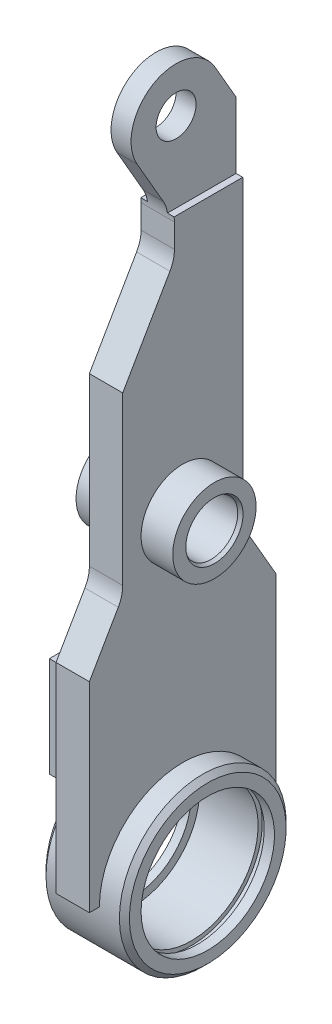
ISO-10303-21;
HEADER;
FILE_DESCRIPTION(('STEP AP214'),'2;1');
FILE_NAME('part.step','',(''),(''),'','','');
FILE_SCHEMA(('AUTOMOTIVE_DESIGN { 1 0 10303 214 1 1 1 1 }'));
ENDSEC;
DATA;
#1=APPLICATION_CONTEXT('core data for automotive mechanical design processes');
#2=APPLICATION_PROTOCOL_DEFINITION('international standard','automotive_design',2000,#1);
#3=PRODUCT_CONTEXT('',#1,'mechanical');
#4=PRODUCT('Part','Part','',(#3));
#5=PRODUCT_RELATED_PRODUCT_CATEGORY('part','',(#4));
#6=PRODUCT_DEFINITION_FORMATION('','',#4);
#7=PRODUCT_DEFINITION_CONTEXT('part definition',#1,'design');
#8=PRODUCT_DEFINITION('design','',#6,#7);
#9=PRODUCT_DEFINITION_SHAPE('','',#8);
#10=(LENGTH_UNIT() NAMED_UNIT(*) SI_UNIT(.MILLI.,.METRE.));
#11=(NAMED_UNIT(*) PLANE_ANGLE_UNIT() SI_UNIT($,.RADIAN.));
#12=(NAMED_UNIT(*) SI_UNIT($,.STERADIAN.) SOLID_ANGLE_UNIT());
#13=UNCERTAINTY_MEASURE_WITH_UNIT(LENGTH_MEASURE(1.E-05),#10,'distance_accuracy_value','');
#14=(GEOMETRIC_REPRESENTATION_CONTEXT(3) GLOBAL_UNCERTAINTY_ASSIGNED_CONTEXT((#13)) GLOBAL_UNIT_ASSIGNED_CONTEXT((#10,
#11,#12)) REPRESENTATION_CONTEXT('',''));
#15=CARTESIAN_POINT('',(0.,0.,0.));
#16=DIRECTION('',(0.,0.,1.));
#17=DIRECTION('',(1.,0.,0.));
#18=AXIS2_PLACEMENT_3D('',#15,#16,#17);
#19=CARTESIAN_POINT('',(14.5,90.,0.));
#20=DIRECTION('',(1.,0.,0.));
#21=DIRECTION('',(0.,0.,-1.));
#22=AXIS2_PLACEMENT_3D('',#19,#20,#21);
#23=PLANE('',#22);
#24=CARTESIAN_POINT('',(14.5,90.,0.));
#25=DIRECTION('',(1.,0.,0.));
#26=DIRECTION('',(0.,0.,-1.));
#27=AXIS2_PLACEMENT_3D('',#24,#25,#26);
#28=CIRCLE('',#27,8.57735026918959);
#29=CARTESIAN_POINT('',(14.5,90.,-8.57735026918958));
#30=VERTEX_POINT('',#29);
#31=EDGE_CURVE('E48',#30,#30,#28,.F.);
#32=ORIENTED_EDGE('',*,*,#31,.T.);
#33=EDGE_LOOP('',(#32));
#34=FACE_BOUND('',#33,.T.);
#35=CARTESIAN_POINT('',(14.5,90.,0.));
#36=DIRECTION('',(1.,0.,0.));
#37=DIRECTION('',(0.,0.,-1.));
#38=AXIS2_PLACEMENT_3D('',#35,#36,#37);
#39=CIRCLE('',#38,12.5);
#40=CARTESIAN_POINT('',(14.5,90.,12.5));
#41=VERTEX_POINT('',#40);
#42=EDGE_CURVE('E61',#41,#41,#39,.T.);
#43=ORIENTED_EDGE('',*,*,#42,.T.);
#44=EDGE_LOOP('',(#43));
#45=FACE_BOUND('',#44,.T.);
#46=ADVANCED_FACE('F41',(#34,#45),#23,.T.);
#47=CARTESIAN_POINT('',(-14.5,90.,0.));
#48=DIRECTION('',(1.,0.,0.));
#49=DIRECTION('',(0.,0.,-1.));
#50=AXIS2_PLACEMENT_3D('',#47,#48,#49);
#51=PLANE('',#50);
#52=CARTESIAN_POINT('',(-14.5,90.,0.));
#53=DIRECTION('',(1.,0.,0.));
#54=DIRECTION('',(0.,0.,-1.));
#55=AXIS2_PLACEMENT_3D('',#52,#53,#54);
#56=CIRCLE('',#55,8.57735026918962);
#57=CARTESIAN_POINT('',(-14.5,90.,-8.5773502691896));
#58=VERTEX_POINT('',#57);
#59=EDGE_CURVE('E11',#58,#58,#56,.T.);
#60=ORIENTED_EDGE('',*,*,#59,.T.);
#61=EDGE_LOOP('',(#60));
#62=FACE_BOUND('',#61,.T.);
#63=CARTESIAN_POINT('',(-14.5,90.,0.));
#64=DIRECTION('',(1.,0.,0.));
#65=DIRECTION('',(0.,0.,-1.));
#66=AXIS2_PLACEMENT_3D('',#63,#64,#65);
#67=CIRCLE('',#66,12.5);
#68=CARTESIAN_POINT('',(-14.5,90.,12.5));
#69=VERTEX_POINT('',#68);
#70=EDGE_CURVE('E64',#69,#69,#67,.T.);
#71=ORIENTED_EDGE('',*,*,#70,.F.);
#72=EDGE_LOOP('',(#71));
#73=FACE_BOUND('',#72,.T.);
#74=ADVANCED_FACE('F69',(#62,#73),#51,.F.);
#75=CARTESIAN_POINT('',(14.5,90.,0.));
#76=DIRECTION('',(-1.,0.,0.));
#77=DIRECTION('',(0.,0.,1.));
#78=AXIS2_PLACEMENT_3D('',#75,#76,#77);
#79=CYLINDRICAL_SURFACE('',#78,12.5);
#80=CARTESIAN_POINT('',(14.5,90.,12.5));
#81=CARTESIAN_POINT('',(14.1979166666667,90.,12.5));
#82=CARTESIAN_POINT('',(13.8958333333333,90.,12.5));
#83=CARTESIAN_POINT('',(13.2916666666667,90.,12.5));
#84=CARTESIAN_POINT('',(12.9895833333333,90.,12.5));
#85=CARTESIAN_POINT('',(12.3854166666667,90.,12.5));
#86=CARTESIAN_POINT('',(12.0833333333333,90.,12.5));
#87=CARTESIAN_POINT('',(11.4791666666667,90.,12.5));
#88=CARTESIAN_POINT('',(11.1770833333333,90.,12.5));
#89=CARTESIAN_POINT('',(10.5729166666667,90.,12.5));
#90=CARTESIAN_POINT('',(10.2708333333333,90.,12.5));
#91=CARTESIAN_POINT('',(9.66666666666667,90.,12.5));
#92=CARTESIAN_POINT('',(9.36458333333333,90.,12.5));
#93=CARTESIAN_POINT('',(8.76041666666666,90.,12.5));
#94=CARTESIAN_POINT('',(8.45833333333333,90.,12.5));
#95=CARTESIAN_POINT('',(7.85416666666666,90.,12.5));
#96=CARTESIAN_POINT('',(7.55208333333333,90.,12.5));
#97=CARTESIAN_POINT('',(6.94791666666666,90.,12.5));
#98=CARTESIAN_POINT('',(6.64583333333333,90.,12.5));
#99=CARTESIAN_POINT('',(6.04166666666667,90.,12.5));
#100=CARTESIAN_POINT('',(5.73958333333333,90.,12.5));
#101=CARTESIAN_POINT('',(5.13541666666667,90.,12.5));
#102=CARTESIAN_POINT('',(4.83333333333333,90.,12.5));
#103=CARTESIAN_POINT('',(4.22916666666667,90.,12.5));
#104=CARTESIAN_POINT('',(3.92708333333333,90.,12.5));
#105=CARTESIAN_POINT('',(3.32291666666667,90.,12.5));
#106=CARTESIAN_POINT('',(3.02083333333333,90.,12.5));
#107=CARTESIAN_POINT('',(2.41666666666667,90.,12.5));
#108=CARTESIAN_POINT('',(2.11458333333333,90.,12.5));
#109=CARTESIAN_POINT('',(1.51041666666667,90.,12.5));
#110=CARTESIAN_POINT('',(1.20833333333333,90.,12.5));
#111=CARTESIAN_POINT('',(0.604166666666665,90.,12.5));
#112=CARTESIAN_POINT('',(0.302083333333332,90.,12.5));
#113=CARTESIAN_POINT('',(-0.302083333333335,90.,12.5));
#114=CARTESIAN_POINT('',(-0.604166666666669,90.,12.5));
#115=CARTESIAN_POINT('',(-1.20833333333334,90.,12.5));
#116=CARTESIAN_POINT('',(-1.51041666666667,90.,12.5));
#117=CARTESIAN_POINT('',(-2.11458333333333,90.,12.5));
#118=CARTESIAN_POINT('',(-2.41666666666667,90.,12.5));
#119=CARTESIAN_POINT('',(-3.02083333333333,90.,12.5));
#120=CARTESIAN_POINT('',(-3.32291666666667,90.,12.5));
#121=CARTESIAN_POINT('',(-3.92708333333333,90.,12.5));
#122=CARTESIAN_POINT('',(-4.22916666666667,90.,12.5));
#123=CARTESIAN_POINT('',(-4.83333333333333,90.,12.5));
#124=CARTESIAN_POINT('',(-5.13541666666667,90.,12.5));
#125=CARTESIAN_POINT('',(-5.73958333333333,90.,12.5));
#126=CARTESIAN_POINT('',(-6.04166666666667,90.,12.5));
#127=CARTESIAN_POINT('',(-6.64583333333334,90.,12.5));
#128=CARTESIAN_POINT('',(-6.94791666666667,90.,12.5));
#129=CARTESIAN_POINT('',(-7.55208333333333,90.,12.5));
#130=CARTESIAN_POINT('',(-7.85416666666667,90.,12.5));
#131=CARTESIAN_POINT('',(-8.45833333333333,90.,12.5));
#132=CARTESIAN_POINT('',(-8.76041666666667,90.,12.5));
#133=CARTESIAN_POINT('',(-9.36458333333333,90.,12.5));
#134=CARTESIAN_POINT('',(-9.66666666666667,90.,12.5));
#135=CARTESIAN_POINT('',(-10.2708333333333,90.,12.5));
#136=CARTESIAN_POINT('',(-10.5729166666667,90.,12.5));
#137=CARTESIAN_POINT('',(-11.1770833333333,90.,12.5));
#138=CARTESIAN_POINT('',(-11.4791666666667,90.,12.5));
#139=CARTESIAN_POINT('',(-12.0833333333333,90.,12.5));
#140=CARTESIAN_POINT('',(-12.3854166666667,90.,12.5));
#141=CARTESIAN_POINT('',(-12.9895833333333,90.,12.5));
#142=CARTESIAN_POINT('',(-13.2916666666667,90.,12.5));
#143=CARTESIAN_POINT('',(-13.8958333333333,90.,12.5));
#144=CARTESIAN_POINT('',(-14.1979166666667,90.,12.5));
#145=CARTESIAN_POINT('',(-14.5,90.,12.5));
#146=B_SPLINE_CURVE_WITH_KNOTS('',3,(#80,#81,#82,#83,#84,#85,#86,#87,#88,#89,#90,#91,#92,#93,
#94,#95,#96,#97,#98,#99,#100,#101,#102,#103,#104,#105,#106,#107,#108,#109,#110,#111,#112,#113,
#114,#115,#116,#117,#118,#119,#120,#121,#122,#123,#124,#125,#126,#127,#128,#129,#130,#131,#132,
#133,#134,#135,#136,#137,#138,#139,#140,#141,#142,#143,#144,#145),.UNSPECIFIED.,.F.,.F.,(4,2,2,
2,2,2,2,2,2,2,2,2,2,2,2,2,2,2,2,2,2,2,2,2,2,2,2,2,2,2,2,2,4),(0.,0.906250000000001,1.8125,
2.71875,3.625,4.53125,5.4375,6.34375,7.25,8.15625,9.0625,9.96875,10.875,11.78125,12.6875,
13.59375,14.5,15.40625,16.3125,17.21875,18.125,19.03125,19.9375,20.84375,21.75,22.65625,23.5625,
24.46875,25.375,26.28125,27.1875,28.09375,29.),.UNSPECIFIED.);
#147=EDGE_CURVE('BSEAM43',#41,#69,#146,.T.);
#148=ORIENTED_EDGE('',*,*,#42,.F.);
#149=ORIENTED_EDGE('',*,*,#70,.T.);
#150=ORIENTED_EDGE('',*,*,#147,.T.);
#151=ORIENTED_EDGE('',*,*,#147,.F.);
#152=EDGE_LOOP('',(#148,#150,#149,#151));
#153=FACE_BOUND('',#152,.T.);
#154=ADVANCED_FACE('F43',(#153),#79,.T.);
#155=CARTESIAN_POINT('',(14.5,90.,0.));
#156=DIRECTION('',(-1.,0.,0.));
#157=DIRECTION('',(0.,0.,1.));
#158=AXIS2_PLACEMENT_3D('',#155,#156,#157);
#159=CYLINDRICAL_SURFACE('',#158,8.);
#160=CARTESIAN_POINT('',(13.5000000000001,90.,0.));
#161=DIRECTION('',(1.,0.,0.));
#162=DIRECTION('',(0.,0.,-1.));
#163=AXIS2_PLACEMENT_3D('',#160,#161,#162);
#164=CIRCLE('',#163,8.);
#165=CARTESIAN_POINT('',(13.5000000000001,90.,8.00000000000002));
#166=VERTEX_POINT('',#165);
#167=EDGE_CURVE('E52',#166,#166,#164,.T.);
#168=CARTESIAN_POINT('',(-13.5,90.,0.));
#169=DIRECTION('',(1.,0.,0.));
#170=DIRECTION('',(0.,0.,-1.));
#171=AXIS2_PLACEMENT_3D('',#168,#169,#170);
#172=CIRCLE('',#171,8.);
#173=CARTESIAN_POINT('',(-13.5,90.,8.00000000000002));
#174=VERTEX_POINT('',#173);
#175=EDGE_CURVE('E56',#174,#174,#172,.F.);
#176=CARTESIAN_POINT('',(13.5000000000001,90.,8.00000000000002));
#177=CARTESIAN_POINT('',(13.2187500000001,90.,8.00000000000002));
#178=CARTESIAN_POINT('',(12.9375000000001,90.,8.00000000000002));
#179=CARTESIAN_POINT('',(12.3750000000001,90.,8.00000000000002));
#180=CARTESIAN_POINT('',(12.09375,90.,8.00000000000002));
#181=CARTESIAN_POINT('',(11.53125,90.,8.00000000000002));
#182=CARTESIAN_POINT('',(11.25,90.,8.00000000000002));
#183=CARTESIAN_POINT('',(10.6875,90.,8.00000000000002));
#184=CARTESIAN_POINT('',(10.40625,90.,8.00000000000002));
#185=CARTESIAN_POINT('',(9.84375000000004,90.,8.00000000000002));
#186=CARTESIAN_POINT('',(9.56250000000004,90.,8.00000000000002));
#187=CARTESIAN_POINT('',(9.00000000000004,90.,8.00000000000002));
#188=CARTESIAN_POINT('',(8.71875000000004,90.,8.00000000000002));
#189=CARTESIAN_POINT('',(8.15625000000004,90.,8.00000000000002));
#190=CARTESIAN_POINT('',(7.87500000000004,90.,8.00000000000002));
#191=CARTESIAN_POINT('',(7.31250000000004,90.,8.00000000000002));
#192=CARTESIAN_POINT('',(7.03125000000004,90.,8.00000000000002));
#193=CARTESIAN_POINT('',(6.46875000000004,90.,8.00000000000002));
#194=CARTESIAN_POINT('',(6.18750000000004,90.,8.00000000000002));
#195=CARTESIAN_POINT('',(5.62500000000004,90.,8.00000000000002));
#196=CARTESIAN_POINT('',(5.34375000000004,90.,8.00000000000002));
#197=CARTESIAN_POINT('',(4.78125000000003,90.,8.00000000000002));
#198=CARTESIAN_POINT('',(4.50000000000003,90.,8.00000000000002));
#199=CARTESIAN_POINT('',(3.93750000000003,90.,8.00000000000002));
#200=CARTESIAN_POINT('',(3.65625000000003,90.,8.00000000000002));
#201=CARTESIAN_POINT('',(3.09375000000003,90.,8.00000000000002));
#202=CARTESIAN_POINT('',(2.81250000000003,90.,8.00000000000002));
#203=CARTESIAN_POINT('',(2.25000000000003,90.,8.00000000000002));
#204=CARTESIAN_POINT('',(1.96875000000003,90.,8.00000000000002));
#205=CARTESIAN_POINT('',(1.40625000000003,90.,8.00000000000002));
#206=CARTESIAN_POINT('',(1.12500000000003,90.,8.00000000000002));
#207=CARTESIAN_POINT('',(0.562500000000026,90.,8.00000000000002));
#208=CARTESIAN_POINT('',(0.281250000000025,90.,8.00000000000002));
#209=CARTESIAN_POINT('',(-0.281249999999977,90.,8.00000000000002));
#210=CARTESIAN_POINT('',(-0.562499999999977,90.,8.00000000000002));
#211=CARTESIAN_POINT('',(-1.12499999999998,90.,8.00000000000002));
#212=CARTESIAN_POINT('',(-1.40624999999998,90.,8.00000000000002));
#213=CARTESIAN_POINT('',(-1.96874999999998,90.,8.00000000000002));
#214=CARTESIAN_POINT('',(-2.24999999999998,90.,8.00000000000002));
#215=CARTESIAN_POINT('',(-2.81249999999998,90.,8.00000000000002));
#216=CARTESIAN_POINT('',(-3.09374999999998,90.,8.00000000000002));
#217=CARTESIAN_POINT('',(-3.65624999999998,90.,8.00000000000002));
#218=CARTESIAN_POINT('',(-3.93749999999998,90.,8.00000000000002));
#219=CARTESIAN_POINT('',(-4.49999999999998,90.,8.00000000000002));
#220=CARTESIAN_POINT('',(-4.78124999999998,90.,8.00000000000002));
#221=CARTESIAN_POINT('',(-5.34374999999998,90.,8.00000000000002));
#222=CARTESIAN_POINT('',(-5.62499999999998,90.,8.00000000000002));
#223=CARTESIAN_POINT('',(-6.18749999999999,90.,8.00000000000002));
#224=CARTESIAN_POINT('',(-6.46874999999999,90.,8.00000000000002));
#225=CARTESIAN_POINT('',(-7.03124999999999,90.,8.00000000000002));
#226=CARTESIAN_POINT('',(-7.31249999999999,90.,8.00000000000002));
#227=CARTESIAN_POINT('',(-7.87499999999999,90.,8.00000000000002));
#228=CARTESIAN_POINT('',(-8.15624999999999,90.,8.00000000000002));
#229=CARTESIAN_POINT('',(-8.71874999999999,90.,8.00000000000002));
#230=CARTESIAN_POINT('',(-8.99999999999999,90.,8.00000000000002));
#231=CARTESIAN_POINT('',(-9.56249999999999,90.,8.00000000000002));
#232=CARTESIAN_POINT('',(-9.84374999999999,90.,8.00000000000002));
#233=CARTESIAN_POINT('',(-10.40625,90.,8.00000000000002));
#234=CARTESIAN_POINT('',(-10.6875,90.,8.00000000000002));
#235=CARTESIAN_POINT('',(-11.25,90.,8.00000000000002));
#236=CARTESIAN_POINT('',(-11.53125,90.,8.00000000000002));
#237=CARTESIAN_POINT('',(-12.09375,90.,8.00000000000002));
#238=CARTESIAN_POINT('',(-12.375,90.,8.00000000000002));
#239=CARTESIAN_POINT('',(-12.9375,90.,8.00000000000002));
#240=CARTESIAN_POINT('',(-13.21875,90.,8.00000000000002));
#241=CARTESIAN_POINT('',(-13.5,90.,8.00000000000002));
#242=B_SPLINE_CURVE_WITH_KNOTS('',3,(#176,#177,#178,#179,#180,#181,#182,#183,#184,#185,#186,
#187,#188,#189,#190,#191,#192,#193,#194,#195,#196,#197,#198,#199,#200,#201,#202,#203,#204,#205,
#206,#207,#208,#209,#210,#211,#212,#213,#214,#215,#216,#217,#218,#219,#220,#221,#222,#223,#224,
#225,#226,#227,#228,#229,#230,#231,#232,#233,#234,#235,#236,#237,#238,#239,#240,#241),
.UNSPECIFIED.,.F.,.F.,(4,2,2,2,2,2,2,2,2,2,2,2,2,2,2,2,2,2,2,2,2,2,2,2,2,2,2,2,2,2,2,2,4),(0.,
0.843750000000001,1.6875,2.53125,3.375,4.21875000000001,5.06250000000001,5.90625000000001,
6.75000000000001,7.59375000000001,8.43750000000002,9.28125000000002,10.125,10.96875,11.8125,
12.65625,13.5,14.34375,15.1875,16.03125,16.875,17.71875,18.5625,19.40625,20.25,21.09375,21.9375,
22.78125,23.625,24.46875,25.3125,26.1562500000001,27.0000000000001),.UNSPECIFIED.);
#243=EDGE_CURVE('BSEAM76',#166,#174,#242,.T.);
#244=ORIENTED_EDGE('',*,*,#167,.T.);
#245=ORIENTED_EDGE('',*,*,#175,.T.);
#246=ORIENTED_EDGE('',*,*,#243,.T.);
#247=ORIENTED_EDGE('',*,*,#243,.F.);
#248=EDGE_LOOP('',(#244,#246,#245,#247));
#249=FACE_BOUND('',#248,.T.);
#250=ADVANCED_FACE('F76',(#249),#159,.F.);
#251=CARTESIAN_POINT('',(13.5000000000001,90.,0.));
#252=DIRECTION('',(1.,0.,0.));
#253=DIRECTION('',(0.,0.,-1.));
#254=AXIS2_PLACEMENT_3D('',#251,#252,#253);
#255=CONICAL_SURFACE('',#254,8.,0.523598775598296);
#256=ORIENTED_EDGE('',*,*,#31,.F.);
#257=EDGE_LOOP('',(#256));
#258=FACE_BOUND('',#257,.T.);
#259=ORIENTED_EDGE('',*,*,#167,.F.);
#260=EDGE_LOOP('',(#259));
#261=FACE_BOUND('',#260,.T.);
#262=ADVANCED_FACE('F81',(#258,#261),#255,.F.);
#263=CARTESIAN_POINT('',(-14.5,90.,0.));
#264=DIRECTION('',(-1.,0.,0.));
#265=DIRECTION('',(0.,0.,1.));
#266=AXIS2_PLACEMENT_3D('',#263,#264,#265);
#267=CONICAL_SURFACE('',#266,8.57735026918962,0.523598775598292);
#268=ORIENTED_EDGE('',*,*,#175,.F.);
#269=EDGE_LOOP('',(#268));
#270=FACE_BOUND('',#269,.T.);
#271=ORIENTED_EDGE('',*,*,#59,.F.);
#272=EDGE_LOOP('',(#271));
#273=FACE_BOUND('',#272,.T.);
#274=ADVANCED_FACE('F85',(#270,#273),#267,.F.);
#275=CLOSED_SHELL('',(#46,#74,#154,#250,#262,#274));
#276=MANIFOLD_SOLID_BREP('B2',#275);
#277=CARTESIAN_POINT('',(-10.,57.,24.99861005));
#278=DIRECTION('',(0.,0.,1.));
#279=DIRECTION('',(0.,-1.,0.));
#280=AXIS2_PLACEMENT_3D('',#277,#278,#279);
#281=PLANE('',#280);
#282=DIRECTION('',(0.,-1.,0.));
#283=VECTOR('',#282,1.);
#284=CARTESIAN_POINT('',(-5.,57.,24.99861005));
#285=LINE('',#284,#283);
#286=CARTESIAN_POINT('',(-5.,57.,24.99861005));
#287=VERTEX_POINT('',#286);
#288=CARTESIAN_POINT('',(-5.,27.,24.99861005));
#289=VERTEX_POINT('',#288);
#290=EDGE_CURVE('E183',#287,#289,#285,.T.);
#291=ORIENTED_EDGE('',*,*,#290,.F.);
#292=DIRECTION('',(1.,0.,0.));
#293=VECTOR('',#292,1.);
#294=CARTESIAN_POINT('',(-10.,57.,24.99861005));
#295=LINE('',#294,#293);
#296=CARTESIAN_POINT('',(-10.,57.,24.99861005));
#297=VERTEX_POINT('',#296);
#298=EDGE_CURVE('E39',#297,#287,#295,.T.);
#299=ORIENTED_EDGE('',*,*,#298,.F.);
#300=DIRECTION('',(0.,-1.,0.));
#301=VECTOR('',#300,1.);
#302=CARTESIAN_POINT('',(-10.,57.,24.99861005));
#303=LINE('',#302,#301);
#304=CARTESIAN_POINT('',(-10.,27.,24.99861005));
#305=VERTEX_POINT('',#304);
#306=EDGE_CURVE('E185',#297,#305,#303,.T.);
#307=ORIENTED_EDGE('',*,*,#306,.T.);
#308=DIRECTION('',(1.,0.,0.));
#309=VECTOR('',#308,1.);
#310=CARTESIAN_POINT('',(-10.,27.,24.99861005));
#311=LINE('',#310,#309);
#312=EDGE_CURVE('E180',#305,#289,#311,.T.);
#313=ORIENTED_EDGE('',*,*,#312,.T.);
#314=EDGE_LOOP('',(#291,#299,#307,#313));
#315=FACE_BOUND('',#314,.T.);
#316=ADVANCED_FACE('F142',(#315),#281,.T.);
#317=CARTESIAN_POINT('',(-10.,57.,24.99861005));
#318=DIRECTION('',(0.,1.,0.));
#319=DIRECTION('',(0.,0.,1.));
#320=AXIS2_PLACEMENT_3D('',#317,#318,#319);
#321=PLANE('',#320);
#322=DIRECTION('',(0.,0.,1.));
#323=VECTOR('',#322,1.);
#324=CARTESIAN_POINT('',(-5.,57.,24.99861005));
#325=LINE('',#324,#323);
#326=CARTESIAN_POINT('',(-5.,57.,-25.));
#327=VERTEX_POINT('',#326);
#328=EDGE_CURVE('E201',#327,#287,#325,.T.);
#329=ORIENTED_EDGE('',*,*,#328,.F.);
#330=DIRECTION('',(1.,0.,0.));
#331=VECTOR('',#330,1.);
#332=CARTESIAN_POINT('',(-10.,57.,-25.));
#333=LINE('',#332,#331);
#334=CARTESIAN_POINT('',(-10.,57.,-25.));
#335=VERTEX_POINT('',#334);
#336=EDGE_CURVE('E150',#335,#327,#333,.T.);
#337=ORIENTED_EDGE('',*,*,#336,.F.);
#338=DIRECTION('',(0.,0.,1.));
#339=VECTOR('',#338,1.);
#340=CARTESIAN_POINT('',(-10.,57.,24.99861005));
#341=LINE('',#340,#339);
#342=EDGE_CURVE('E190',#335,#297,#341,.T.);
#343=ORIENTED_EDGE('',*,*,#342,.T.);
#344=ORIENTED_EDGE('',*,*,#298,.T.);
#345=EDGE_LOOP('',(#329,#337,#343,#344));
#346=FACE_BOUND('',#345,.T.);
#347=ADVANCED_FACE('F222',(#346),#321,.T.);
#348=CARTESIAN_POINT('',(-10.,57.,-25.));
#349=DIRECTION('',(0.,0.,-1.));
#350=DIRECTION('',(0.,1.,0.));
#351=AXIS2_PLACEMENT_3D('',#348,#349,#350);
#352=PLANE('',#351);
#353=DIRECTION('',(0.,1.,0.));
#354=VECTOR('',#353,1.);
#355=CARTESIAN_POINT('',(-5.,57.,-25.));
#356=LINE('',#355,#354);
#357=CARTESIAN_POINT('',(-5.,27.,-25.));
#358=VERTEX_POINT('',#357);
#359=EDGE_CURVE('E198',#358,#327,#356,.T.);
#360=ORIENTED_EDGE('',*,*,#359,.F.);
#361=DIRECTION('',(1.,0.,0.));
#362=VECTOR('',#361,1.);
#363=CARTESIAN_POINT('',(-10.,27.,-25.));
#364=LINE('',#363,#362);
#365=CARTESIAN_POINT('',(-10.,27.,-25.));
#366=VERTEX_POINT('',#365);
#367=EDGE_CURVE('E189',#366,#358,#364,.T.);
#368=ORIENTED_EDGE('',*,*,#367,.F.);
#369=DIRECTION('',(0.,1.,0.));
#370=VECTOR('',#369,1.);
#371=CARTESIAN_POINT('',(-10.,57.,-25.));
#372=LINE('',#371,#370);
#373=EDGE_CURVE('E214',#366,#335,#372,.T.);
#374=ORIENTED_EDGE('',*,*,#373,.T.);
#375=ORIENTED_EDGE('',*,*,#336,.T.);
#376=EDGE_LOOP('',(#360,#368,#374,#375));
#377=FACE_BOUND('',#376,.T.);
#378=ADVANCED_FACE('F219',(#377),#352,.T.);
#379=CARTESIAN_POINT('',(-10.,27.,24.99861005));
#380=DIRECTION('',(0.,-1.,0.));
#381=DIRECTION('',(0.,0.,-1.));
#382=AXIS2_PLACEMENT_3D('',#379,#380,#381);
#383=PLANE('',#382);
#384=DIRECTION('',(0.,0.,-1.));
#385=VECTOR('',#384,1.);
#386=CARTESIAN_POINT('',(-5.,27.,24.99861005));
#387=LINE('',#386,#385);
#388=EDGE_CURVE('E193',#289,#358,#387,.T.);
#389=ORIENTED_EDGE('',*,*,#388,.F.);
#390=ORIENTED_EDGE('',*,*,#312,.F.);
#391=DIRECTION('',(0.,0.,-1.));
#392=VECTOR('',#391,1.);
#393=CARTESIAN_POINT('',(-10.,27.,24.99861005));
#394=LINE('',#393,#392);
#395=EDGE_CURVE('E212',#305,#366,#394,.T.);
#396=ORIENTED_EDGE('',*,*,#395,.T.);
#397=ORIENTED_EDGE('',*,*,#367,.T.);
#398=EDGE_LOOP('',(#389,#390,#396,#397));
#399=FACE_BOUND('',#398,.T.);
#400=ADVANCED_FACE('F194',(#399),#383,.T.);
#401=CARTESIAN_POINT('',(-10.,27.,24.99861005));
#402=DIRECTION('',(1.,0.,0.));
#403=DIRECTION('',(0.,0.,-1.));
#404=AXIS2_PLACEMENT_3D('',#401,#402,#403);
#405=PLANE('',#404);
#406=CARTESIAN_POINT('',(-10.,35.,-18.));
#407=DIRECTION('',(-1.,0.,0.));
#408=DIRECTION('',(0.,0.,1.));
#409=AXIS2_PLACEMENT_3D('',#406,#407,#408);
#410=CIRCLE('',#409,1.65);
#411=CARTESIAN_POINT('',(-10.,35.,-16.35));
#412=VERTEX_POINT('',#411);
#413=EDGE_CURVE('E289',#412,#412,#410,.T.);
#414=ORIENTED_EDGE('',*,*,#413,.F.);
#415=EDGE_LOOP('',(#414));
#416=FACE_BOUND('',#415,.T.);
#417=CARTESIAN_POINT('',(-10.,49.,18.));
#418=DIRECTION('',(-1.,0.,0.));
#419=DIRECTION('',(0.,0.,1.));
#420=AXIS2_PLACEMENT_3D('',#417,#418,#419);
#421=CIRCLE('',#420,1.65);
#422=CARTESIAN_POINT('',(-10.,49.,19.65));
#423=VERTEX_POINT('',#422);
#424=EDGE_CURVE('E205',#423,#423,#421,.T.);
#425=ORIENTED_EDGE('',*,*,#424,.F.);
#426=EDGE_LOOP('',(#425));
#427=FACE_BOUND('',#426,.T.);
#428=ORIENTED_EDGE('',*,*,#306,.F.);
#429=ORIENTED_EDGE('',*,*,#342,.F.);
#430=ORIENTED_EDGE('',*,*,#373,.F.);
#431=ORIENTED_EDGE('',*,*,#395,.F.);
#432=EDGE_LOOP('',(#428,#429,#430,#431));
#433=FACE_BOUND('',#432,.T.);
#434=ADVANCED_FACE('F224',(#416,#427,#433),#405,.F.);
#435=CARTESIAN_POINT('',(-5.,27.,24.99861005));
#436=DIRECTION('',(1.,0.,0.));
#437=DIRECTION('',(0.,0.,-1.));
#438=AXIS2_PLACEMENT_3D('',#435,#436,#437);
#439=PLANE('',#438);
#440=CARTESIAN_POINT('',(-5.,35.,-18.));
#441=DIRECTION('',(1.,0.,0.));
#442=DIRECTION('',(0.,0.,-1.));
#443=AXIS2_PLACEMENT_3D('',#440,#441,#442);
#444=CIRCLE('',#443,1.65);
#445=CARTESIAN_POINT('',(-5.,35.,-19.65));
#446=VERTEX_POINT('',#445);
#447=EDGE_CURVE('E145',#446,#446,#444,.T.);
#448=ORIENTED_EDGE('',*,*,#447,.F.);
#449=EDGE_LOOP('',(#448));
#450=FACE_BOUND('',#449,.T.);
#451=CARTESIAN_POINT('',(-5.,49.,18.));
#452=DIRECTION('',(1.,0.,0.));
#453=DIRECTION('',(0.,0.,-1.));
#454=AXIS2_PLACEMENT_3D('',#451,#452,#453);
#455=CIRCLE('',#454,1.65);
#456=CARTESIAN_POINT('',(-5.,49.,16.35));
#457=VERTEX_POINT('',#456);
#458=EDGE_CURVE('E202',#457,#457,#455,.T.);
#459=ORIENTED_EDGE('',*,*,#458,.F.);
#460=EDGE_LOOP('',(#459));
#461=FACE_BOUND('',#460,.T.);
#462=ORIENTED_EDGE('',*,*,#290,.T.);
#463=ORIENTED_EDGE('',*,*,#388,.T.);
#464=ORIENTED_EDGE('',*,*,#359,.T.);
#465=ORIENTED_EDGE('',*,*,#328,.T.);
#466=EDGE_LOOP('',(#462,#463,#464,#465));
#467=FACE_BOUND('',#466,.T.);
#468=ADVANCED_FACE('F200',(#450,#461,#467),#439,.T.);
#469=CARTESIAN_POINT('',(-10.,49.,18.));
#470=DIRECTION('',(-1.,0.,0.));
#471=DIRECTION('',(0.,0.,1.));
#472=AXIS2_PLACEMENT_3D('',#469,#470,#471);
#473=CYLINDRICAL_SURFACE('',#472,1.65);
#474=ORIENTED_EDGE('',*,*,#458,.T.);
#475=EDGE_LOOP('',(#474));
#476=FACE_BOUND('',#475,.T.);
#477=ORIENTED_EDGE('',*,*,#424,.T.);
#478=EDGE_LOOP('',(#477));
#479=FACE_BOUND('',#478,.T.);
#480=ADVANCED_FACE('F232',(#476,#479),#473,.F.);
#481=CARTESIAN_POINT('',(-10.,35.,-18.));
#482=DIRECTION('',(-1.,0.,0.));
#483=DIRECTION('',(0.,0.,1.));
#484=AXIS2_PLACEMENT_3D('',#481,#482,#483);
#485=CYLINDRICAL_SURFACE('',#484,1.65);
#486=ORIENTED_EDGE('',*,*,#447,.T.);
#487=EDGE_LOOP('',(#486));
#488=FACE_BOUND('',#487,.T.);
#489=ORIENTED_EDGE('',*,*,#413,.T.);
#490=EDGE_LOOP('',(#489));
#491=FACE_BOUND('',#490,.T.);
#492=ADVANCED_FACE('F271',(#488,#491),#485,.F.);
#493=CLOSED_SHELL('',(#316,#347,#378,#400,#434,#468,#480,#492));
#494=MANIFOLD_SOLID_BREP('B6',#493);
#495=CARTESIAN_POINT('',(-5.,0.,0.));
#496=DIRECTION('',(1.,0.,0.));
#497=DIRECTION('',(0.,0.,-1.));
#498=AXIS2_PLACEMENT_3D('',#495,#496,#497);
#499=PLANE('',#498);
#500=CARTESIAN_POINT('',(-5.,35.,-18.));
#501=DIRECTION('',(1.,0.,0.));
#502=DIRECTION('',(0.,0.,-1.));
#503=AXIS2_PLACEMENT_3D('',#500,#501,#502);
#504=CIRCLE('',#503,1.65);
#505=CARTESIAN_POINT('',(-5.,35.,-19.65));
#506=VERTEX_POINT('',#505);
#507=EDGE_CURVE('E318',#506,#506,#504,.T.);
#508=ORIENTED_EDGE('',*,*,#507,.T.);
#509=EDGE_LOOP('',(#508));
#510=FACE_BOUND('',#509,.T.);
#511=CARTESIAN_POINT('',(-5.,49.,18.));
#512=DIRECTION('',(1.,0.,0.));
#513=DIRECTION('',(0.,0.,-1.));
#514=AXIS2_PLACEMENT_3D('',#511,#512,#513);
#515=CIRCLE('',#514,1.65);
#516=CARTESIAN_POINT('',(-5.,49.,16.35));
#517=VERTEX_POINT('',#516);
#518=EDGE_CURVE('E485',#517,#517,#515,.T.);
#519=ORIENTED_EDGE('',*,*,#518,.T.);
#520=EDGE_LOOP('',(#519));
#521=FACE_BOUND('',#520,.T.);
#522=CARTESIAN_POINT('',(-5.,90.,0.));
#523=DIRECTION('',(1.,0.,0.));
#524=DIRECTION('',(0.,0.,-1.));
#525=AXIS2_PLACEMENT_3D('',#522,#523,#524);
#526=CIRCLE('',#525,12.5);
#527=CARTESIAN_POINT('',(-5.,90.,-12.5));
#528=VERTEX_POINT('',#527);
#529=EDGE_CURVE('E572',#528,#528,#526,.T.);
#530=ORIENTED_EDGE('',*,*,#529,.T.);
#531=EDGE_LOOP('',(#530));
#532=FACE_BOUND('',#531,.T.);
#533=DIRECTION('',(0.,1.,0.));
#534=VECTOR('',#533,1.);
#535=CARTESIAN_POINT('',(-5.,166.650635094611,2.50000000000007));
#536=LINE('',#535,#534);
#537=CARTESIAN_POINT('',(-5.,159.526279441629,2.50000000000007));
#538=VERTEX_POINT('',#537);
#539=CARTESIAN_POINT('',(-5.,166.650635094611,2.50000000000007));
#540=VERTEX_POINT('',#539);
#541=EDGE_CURVE('E503',#538,#540,#536,.T.);
#542=ORIENTED_EDGE('',*,*,#541,.T.);
#543=CARTESIAN_POINT('',(-5.,166.650635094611,12.5000000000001));
#544=DIRECTION('',(1.,0.,0.));
#545=DIRECTION('',(0.,0.,1.));
#546=AXIS2_PLACEMENT_3D('',#543,#544,#545);
#547=CIRCLE('',#546,10.);
#548=CARTESIAN_POINT('',(-5.,168.,2.59145750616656));
#549=VERTEX_POINT('',#548);
#550=EDGE_CURVE('E506',#540,#549,#547,.T.);
#551=ORIENTED_EDGE('',*,*,#550,.T.);
#552=DIRECTION('',(0.,0.,1.));
#553=VECTOR('',#552,1.);
#554=CARTESIAN_POINT('',(-5.,168.,-18.));
#555=LINE('',#554,#553);
#556=CARTESIAN_POINT('',(-5.,168.,-18.));
#557=VERTEX_POINT('',#556);
#558=EDGE_CURVE('E549',#557,#549,#555,.T.);
#559=ORIENTED_EDGE('',*,*,#558,.F.);
#560=DIRECTION('',(0.,-1.,0.));
#561=VECTOR('',#560,1.);
#562=CARTESIAN_POINT('',(-5.,210.,-18.));
#563=LINE('',#562,#561);
#564=CARTESIAN_POINT('',(-5.,80.,-18.));
#565=VERTEX_POINT('',#564);
#566=EDGE_CURVE('E582',#557,#565,#563,.T.);
#567=ORIENTED_EDGE('',*,*,#566,.T.);
#568=CARTESIAN_POINT('',(-5.,80.,-28.));
#569=DIRECTION('',(1.,0.,0.));
#570=DIRECTION('',(0.,0.,-1.));
#571=AXIS2_PLACEMENT_3D('',#568,#569,#570);
#572=CIRCLE('',#571,10.);
#573=CARTESIAN_POINT('',(-5.,75.0000000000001,-19.3397459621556));
#574=VERTEX_POINT('',#573);
#575=EDGE_CURVE('E584',#565,#574,#572,.T.);
#576=ORIENTED_EDGE('',*,*,#575,.T.);
#577=DIRECTION('',(0.,-0.86602540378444,-0.499999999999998));
#578=VECTOR('',#577,1.);
#579=CARTESIAN_POINT('',(-5.,60.,-28.));
#580=LINE('',#579,#578);
#581=CARTESIAN_POINT('',(-5.,60.,-28.));
#582=VERTEX_POINT('',#581);
#583=EDGE_CURVE('E587',#574,#582,#580,.T.);
#584=ORIENTED_EDGE('',*,*,#583,.T.);
#585=DIRECTION('',(0.,1.,0.));
#586=VECTOR('',#585,1.);
#587=CARTESIAN_POINT('',(-5.,210.,-27.9999999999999));
#588=LINE('',#587,#586);
#589=CARTESIAN_POINT('',(-5.,0.,-28.));
#590=VERTEX_POINT('',#589);
#591=EDGE_CURVE('E630',#590,#582,#588,.T.);
#592=ORIENTED_EDGE('',*,*,#591,.F.);
#593=DIRECTION('',(0.,0.,-1.));
#594=VECTOR('',#593,1.);
#595=CARTESIAN_POINT('',(-5.,0.,-25.));
#596=LINE('',#595,#594);
#597=CARTESIAN_POINT('',(-5.,0.,-25.));
#598=VERTEX_POINT('',#597);
#599=EDGE_CURVE('E628',#598,#590,#596,.T.);
#600=ORIENTED_EDGE('',*,*,#599,.F.);
#601=CARTESIAN_POINT('',(-5.,0.,0.));
#602=DIRECTION('',(-1.,0.,0.));
#603=DIRECTION('',(0.,0.,-1.));
#604=AXIS2_PLACEMENT_3D('',#601,#602,#603);
#605=CIRCLE('',#604,25.);
#606=CARTESIAN_POINT('',(-5.,0.,25.));
#607=VERTEX_POINT('',#606);
#608=EDGE_CURVE('E626',#607,#598,#605,.T.);
#609=ORIENTED_EDGE('',*,*,#608,.F.);
#610=DIRECTION('',(0.,0.,-1.));
#611=VECTOR('',#610,1.);
#612=CARTESIAN_POINT('',(-5.,0.,25.));
#613=LINE('',#612,#611);
#614=CARTESIAN_POINT('',(-5.,0.,28.));
#615=VERTEX_POINT('',#614);
#616=EDGE_CURVE('E624',#615,#607,#613,.T.);
#617=ORIENTED_EDGE('',*,*,#616,.F.);
#618=DIRECTION('',(0.,-1.,0.));
#619=VECTOR('',#618,1.);
#620=CARTESIAN_POINT('',(-5.,210.,28.0000000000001));
#621=LINE('',#620,#619);
#622=CARTESIAN_POINT('',(-5.,60.,28.));
#623=VERTEX_POINT('',#622);
#624=EDGE_CURVE('E619',#623,#615,#621,.T.);
#625=ORIENTED_EDGE('',*,*,#624,.F.);
#626=DIRECTION('',(0.,0.866025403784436,-0.500000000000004));
#627=VECTOR('',#626,1.);
#628=CARTESIAN_POINT('',(-5.,60.,28.));
#629=LINE('',#628,#627);
#630=CARTESIAN_POINT('',(-5.,74.9999999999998,19.3397459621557));
#631=VERTEX_POINT('',#630);
#632=EDGE_CURVE('E607',#623,#631,#629,.T.);
#633=ORIENTED_EDGE('',*,*,#632,.T.);
#634=CARTESIAN_POINT('',(-5.,79.9999999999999,28.));
#635=DIRECTION('',(1.,0.,0.));
#636=DIRECTION('',(0.,0.,-1.));
#637=AXIS2_PLACEMENT_3D('',#634,#635,#636);
#638=CIRCLE('',#637,10.);
#639=CARTESIAN_POINT('',(-5.,79.9999999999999,18.));
#640=VERTEX_POINT('',#639);
#641=EDGE_CURVE('E610',#631,#640,#638,.T.);
#642=ORIENTED_EDGE('',*,*,#641,.T.);
#643=DIRECTION('',(0.,1.,0.));
#644=VECTOR('',#643,1.);
#645=CARTESIAN_POINT('',(-5.,210.,18.0000000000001));
#646=LINE('',#645,#644);
#647=CARTESIAN_POINT('',(-5.,130.,18.0000000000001));
#648=VERTEX_POINT('',#647);
#649=EDGE_CURVE('E613',#640,#648,#646,.T.);
#650=ORIENTED_EDGE('',*,*,#649,.T.);
#651=DIRECTION('',(0.,0.866025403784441,-0.499999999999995));
#652=VECTOR('',#651,1.);
#653=CARTESIAN_POINT('',(-5.,154.526279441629,3.83974596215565));
#654=LINE('',#653,#652);
#655=CARTESIAN_POINT('',(-5.,154.526279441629,3.83974596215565));
#656=VERTEX_POINT('',#655);
#657=EDGE_CURVE('E497',#648,#656,#654,.T.);
#658=ORIENTED_EDGE('',*,*,#657,.T.);
#659=CARTESIAN_POINT('',(-5.,159.526279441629,12.5000000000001));
#660=DIRECTION('',(1.,0.,0.));
#661=DIRECTION('',(0.,0.,-1.));
#662=AXIS2_PLACEMENT_3D('',#659,#660,#661);
#663=CIRCLE('',#662,10.);
#664=EDGE_CURVE('E500',#656,#538,#663,.T.);
#665=ORIENTED_EDGE('',*,*,#664,.T.);
#666=EDGE_LOOP('',(#542,#551,#559,#567,#576,#584,#592,#600,#609,#617,#625,#633,#642,#650,#658,#665));
#667=FACE_BOUND('',#666,.T.);
#668=ADVANCED_FACE('F314',(#510,#521,#532,#667),#499,.F.);
#669=CARTESIAN_POINT('',(5.,210.,28.0000000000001));
#670=DIRECTION('',(0.,0.,-1.));
#671=DIRECTION('',(0.,1.,0.));
#672=AXIS2_PLACEMENT_3D('',#669,#670,#671);
#673=PLANE('',#672);
#674=DIRECTION('',(0.,-1.,0.));
#675=VECTOR('',#674,1.);
#676=CARTESIAN_POINT('',(5.,210.,28.0000000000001));
#677=LINE('',#676,#675);
#678=CARTESIAN_POINT('',(5.,60.,28.));
#679=VERTEX_POINT('',#678);
#680=CARTESIAN_POINT('',(5.,0.,28.));
#681=VERTEX_POINT('',#680);
#682=EDGE_CURVE('E633',#679,#681,#677,.T.);
#683=ORIENTED_EDGE('',*,*,#682,.F.);
#684=DIRECTION('',(1.,0.,0.));
#685=VECTOR('',#684,1.);
#686=CARTESIAN_POINT('',(-5.,60.,28.));
#687=LINE('',#686,#685);
#688=EDGE_CURVE('E616',#623,#679,#687,.T.);
#689=ORIENTED_EDGE('',*,*,#688,.F.);
#690=ORIENTED_EDGE('',*,*,#624,.T.);
#691=DIRECTION('',(-1.,0.,0.));
#692=VECTOR('',#691,1.);
#693=CARTESIAN_POINT('',(5.,0.,28.));
#694=LINE('',#693,#692);
#695=EDGE_CURVE('E653',#681,#615,#694,.T.);
#696=ORIENTED_EDGE('',*,*,#695,.F.);
#697=EDGE_LOOP('',(#683,#689,#690,#696));
#698=FACE_BOUND('',#697,.T.);
#699=ADVANCED_FACE('F316',(#698),#673,.F.);
#700=CARTESIAN_POINT('',(5.,0.,25.));
#701=DIRECTION('',(0.,1.,0.));
#702=DIRECTION('',(0.,0.,1.));
#703=AXIS2_PLACEMENT_3D('',#700,#701,#702);
#704=PLANE('',#703);
#705=ORIENTED_EDGE('',*,*,#616,.T.);
#706=DIRECTION('',(-1.,0.,0.));
#707=VECTOR('',#706,1.);
#708=CARTESIAN_POINT('',(5.,0.,25.));
#709=LINE('',#708,#707);
#710=CARTESIAN_POINT('',(5.,0.,25.));
#711=VERTEX_POINT('',#710);
#712=EDGE_CURVE('E650',#711,#607,#709,.T.);
#713=ORIENTED_EDGE('',*,*,#712,.F.);
#714=DIRECTION('',(0.,0.,-1.));
#715=VECTOR('',#714,1.);
#716=CARTESIAN_POINT('',(5.,0.,25.));
#717=LINE('',#716,#715);
#718=EDGE_CURVE('E635',#681,#711,#717,.T.);
#719=ORIENTED_EDGE('',*,*,#718,.F.);
#720=ORIENTED_EDGE('',*,*,#695,.T.);
#721=EDGE_LOOP('',(#705,#713,#719,#720));
#722=FACE_BOUND('',#721,.T.);
#723=ADVANCED_FACE('F692',(#722),#704,.F.);
#724=CARTESIAN_POINT('',(5.,0.,0.));
#725=DIRECTION('',(-1.,0.,0.));
#726=DIRECTION('',(0.,0.,1.));
#727=AXIS2_PLACEMENT_3D('',#724,#725,#726);
#728=CYLINDRICAL_SURFACE('',#727,25.);
#729=ORIENTED_EDGE('',*,*,#608,.T.);
#730=DIRECTION('',(-1.,0.,0.));
#731=VECTOR('',#730,1.);
#732=CARTESIAN_POINT('',(5.,0.,-25.));
#733=LINE('',#732,#731);
#734=CARTESIAN_POINT('',(5.,0.,-25.));
#735=VERTEX_POINT('',#734);
#736=EDGE_CURVE('E647',#735,#598,#733,.T.);
#737=ORIENTED_EDGE('',*,*,#736,.F.);
#738=CARTESIAN_POINT('',(5.,0.,0.));
#739=DIRECTION('',(-1.,0.,0.));
#740=DIRECTION('',(0.,0.,-1.));
#741=AXIS2_PLACEMENT_3D('',#738,#739,#740);
#742=CIRCLE('',#741,25.);
#743=EDGE_CURVE('E637',#711,#735,#742,.T.);
#744=ORIENTED_EDGE('',*,*,#743,.F.);
#745=ORIENTED_EDGE('',*,*,#712,.T.);
#746=EDGE_LOOP('',(#729,#737,#744,#745));
#747=FACE_BOUND('',#746,.T.);
#748=ADVANCED_FACE('F710',(#747),#728,.F.);
#749=CARTESIAN_POINT('',(5.,0.,-25.));
#750=DIRECTION('',(0.,1.,0.));
#751=DIRECTION('',(0.,0.,1.));
#752=AXIS2_PLACEMENT_3D('',#749,#750,#751);
#753=PLANE('',#752);
#754=ORIENTED_EDGE('',*,*,#599,.T.);
#755=DIRECTION('',(-1.,0.,0.));
#756=VECTOR('',#755,1.);
#757=CARTESIAN_POINT('',(5.,0.,-28.));
#758=LINE('',#757,#756);
#759=CARTESIAN_POINT('',(5.,0.,-28.));
#760=VERTEX_POINT('',#759);
#761=EDGE_CURVE('E644',#760,#590,#758,.T.);
#762=ORIENTED_EDGE('',*,*,#761,.F.);
#763=DIRECTION('',(0.,0.,-1.));
#764=VECTOR('',#763,1.);
#765=CARTESIAN_POINT('',(5.,0.,-25.));
#766=LINE('',#765,#764);
#767=EDGE_CURVE('E639',#735,#760,#766,.T.);
#768=ORIENTED_EDGE('',*,*,#767,.F.);
#769=ORIENTED_EDGE('',*,*,#736,.T.);
#770=EDGE_LOOP('',(#754,#762,#768,#769));
#771=FACE_BOUND('',#770,.T.);
#772=ADVANCED_FACE('F706',(#771),#753,.F.);
#773=CARTESIAN_POINT('',(5.,210.,-27.9999999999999));
#774=DIRECTION('',(0.,0.,1.));
#775=DIRECTION('',(0.,-1.,0.));
#776=AXIS2_PLACEMENT_3D('',#773,#774,#775);
#777=PLANE('',#776);
#778=ORIENTED_EDGE('',*,*,#591,.T.);
#779=DIRECTION('',(1.,0.,0.));
#780=VECTOR('',#779,1.);
#781=CARTESIAN_POINT('',(-5.,60.,-28.));
#782=LINE('',#781,#780);
#783=CARTESIAN_POINT('',(5.,60.,-28.));
#784=VERTEX_POINT('',#783);
#785=EDGE_CURVE('E591',#582,#784,#782,.T.);
#786=ORIENTED_EDGE('',*,*,#785,.T.);
#787=DIRECTION('',(0.,1.,0.));
#788=VECTOR('',#787,1.);
#789=CARTESIAN_POINT('',(5.,210.,-27.9999999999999));
#790=LINE('',#789,#788);
#791=EDGE_CURVE('E641',#760,#784,#790,.T.);
#792=ORIENTED_EDGE('',*,*,#791,.F.);
#793=ORIENTED_EDGE('',*,*,#761,.T.);
#794=EDGE_LOOP('',(#778,#786,#792,#793));
#795=FACE_BOUND('',#794,.T.);
#796=ADVANCED_FACE('F702',(#795),#777,.F.);
#797=CARTESIAN_POINT('',(5.,0.,0.));
#798=DIRECTION('',(1.,0.,0.));
#799=DIRECTION('',(0.,0.,-1.));
#800=AXIS2_PLACEMENT_3D('',#797,#798,#799);
#801=PLANE('',#800);
#802=CARTESIAN_POINT('',(5.,166.650635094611,12.5000000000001));
#803=DIRECTION('',(1.,0.,0.));
#804=DIRECTION('',(0.,0.,1.));
#805=AXIS2_PLACEMENT_3D('',#802,#803,#804);
#806=CIRCLE('',#805,10.);
#807=CARTESIAN_POINT('',(5.,166.650635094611,2.50000000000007));
#808=VERTEX_POINT('',#807);
#809=CARTESIAN_POINT('',(5.,168.,2.59145750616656));
#810=VERTEX_POINT('',#809);
#811=EDGE_CURVE('E495',#808,#810,#806,.T.);
#812=ORIENTED_EDGE('',*,*,#811,.F.);
#813=DIRECTION('',(0.,1.,0.));
#814=VECTOR('',#813,1.);
#815=CARTESIAN_POINT('',(5.,166.650635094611,2.50000000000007));
#816=LINE('',#815,#814);
#817=CARTESIAN_POINT('',(5.,159.526279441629,2.50000000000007));
#818=VERTEX_POINT('',#817);
#819=EDGE_CURVE('E492',#818,#808,#816,.T.);
#820=ORIENTED_EDGE('',*,*,#819,.F.);
#821=CARTESIAN_POINT('',(5.,159.526279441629,12.5000000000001));
#822=DIRECTION('',(1.,0.,0.));
#823=DIRECTION('',(0.,0.,-1.));
#824=AXIS2_PLACEMENT_3D('',#821,#822,#823);
#825=CIRCLE('',#824,10.);
#826=CARTESIAN_POINT('',(5.,154.526279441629,3.83974596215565));
#827=VERTEX_POINT('',#826);
#828=EDGE_CURVE('E489',#827,#818,#825,.T.);
#829=ORIENTED_EDGE('',*,*,#828,.F.);
#830=DIRECTION('',(0.,0.866025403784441,-0.499999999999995));
#831=VECTOR('',#830,1.);
#832=CARTESIAN_POINT('',(5.,154.526279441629,3.83974596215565));
#833=LINE('',#832,#831);
#834=CARTESIAN_POINT('',(5.,130.,18.0000000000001));
#835=VERTEX_POINT('',#834);
#836=EDGE_CURVE('E486',#835,#827,#833,.T.);
#837=ORIENTED_EDGE('',*,*,#836,.F.);
#838=DIRECTION('',(0.,1.,0.));
#839=VECTOR('',#838,1.);
#840=CARTESIAN_POINT('',(5.,210.,18.0000000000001));
#841=LINE('',#840,#839);
#842=CARTESIAN_POINT('',(5.,79.9999999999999,18.));
#843=VERTEX_POINT('',#842);
#844=EDGE_CURVE('E604',#843,#835,#841,.T.);
#845=ORIENTED_EDGE('',*,*,#844,.F.);
#846=CARTESIAN_POINT('',(5.,79.9999999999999,28.));
#847=DIRECTION('',(1.,0.,0.));
#848=DIRECTION('',(0.,0.,-1.));
#849=AXIS2_PLACEMENT_3D('',#846,#847,#848);
#850=CIRCLE('',#849,10.);
#851=CARTESIAN_POINT('',(5.,74.9999999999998,19.3397459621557));
#852=VERTEX_POINT('',#851);
#853=EDGE_CURVE('E601',#852,#843,#850,.T.);
#854=ORIENTED_EDGE('',*,*,#853,.F.);
#855=DIRECTION('',(0.,0.866025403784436,-0.500000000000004));
#856=VECTOR('',#855,1.);
#857=CARTESIAN_POINT('',(5.,60.,28.));
#858=LINE('',#857,#856);
#859=EDGE_CURVE('E594',#679,#852,#858,.T.);
#860=ORIENTED_EDGE('',*,*,#859,.F.);
#861=ORIENTED_EDGE('',*,*,#682,.T.);
#862=ORIENTED_EDGE('',*,*,#718,.T.);
#863=ORIENTED_EDGE('',*,*,#743,.T.);
#864=ORIENTED_EDGE('',*,*,#767,.T.);
#865=ORIENTED_EDGE('',*,*,#791,.T.);
#866=DIRECTION('',(0.,-0.86602540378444,-0.499999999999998));
#867=VECTOR('',#866,1.);
#868=CARTESIAN_POINT('',(5.,60.,-28.));
#869=LINE('',#868,#867);
#870=CARTESIAN_POINT('',(5.,75.0000000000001,-19.3397459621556));
#871=VERTEX_POINT('',#870);
#872=EDGE_CURVE('E580',#871,#784,#869,.T.);
#873=ORIENTED_EDGE('',*,*,#872,.F.);
#874=CARTESIAN_POINT('',(5.,80.,-28.));
#875=DIRECTION('',(1.,0.,0.));
#876=DIRECTION('',(0.,0.,-1.));
#877=AXIS2_PLACEMENT_3D('',#874,#875,#876);
#878=CIRCLE('',#877,10.);
#879=CARTESIAN_POINT('',(5.,80.,-18.));
#880=VERTEX_POINT('',#879);
#881=EDGE_CURVE('E577',#880,#871,#878,.T.);
#882=ORIENTED_EDGE('',*,*,#881,.F.);
#883=DIRECTION('',(0.,-1.,0.));
#884=VECTOR('',#883,1.);
#885=CARTESIAN_POINT('',(5.,210.,-18.));
#886=LINE('',#885,#884);
#887=CARTESIAN_POINT('',(5.,168.,-18.));
#888=VERTEX_POINT('',#887);
#889=EDGE_CURVE('E575',#888,#880,#886,.T.);
#890=ORIENTED_EDGE('',*,*,#889,.F.);
#891=DIRECTION('',(0.,0.,-1.));
#892=VECTOR('',#891,1.);
#893=CARTESIAN_POINT('',(5.,168.,-18.));
#894=LINE('',#893,#892);
#895=EDGE_CURVE('E558',#810,#888,#894,.T.);
#896=ORIENTED_EDGE('',*,*,#895,.F.);
#897=EDGE_LOOP('',(#812,#820,#829,#837,#845,#854,#860,#861,#862,#863,#864,#865,#873,#882,#890,#896));
#898=FACE_BOUND('',#897,.T.);
#899=CARTESIAN_POINT('',(5.,90.,0.));
#900=DIRECTION('',(1.,0.,0.));
#901=DIRECTION('',(0.,0.,-1.));
#902=AXIS2_PLACEMENT_3D('',#899,#900,#901);
#903=CIRCLE('',#902,12.5);
#904=CARTESIAN_POINT('',(5.,90.,-12.5));
#905=VERTEX_POINT('',#904);
#906=EDGE_CURVE('E569',#905,#905,#903,.T.);
#907=ORIENTED_EDGE('',*,*,#906,.F.);
#908=EDGE_LOOP('',(#907));
#909=FACE_BOUND('',#908,.T.);
#910=ADVANCED_FACE('F698',(#898,#909),#801,.T.);
#911=CARTESIAN_POINT('',(-5.,210.,18.0000000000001));
#912=DIRECTION('',(0.,0.,-1.));
#913=DIRECTION('',(0.,1.,0.));
#914=AXIS2_PLACEMENT_3D('',#911,#912,#913);
#915=PLANE('',#914);
#916=ORIENTED_EDGE('',*,*,#844,.T.);
#917=DIRECTION('',(1.,0.,0.));
#918=VECTOR('',#917,1.);
#919=CARTESIAN_POINT('',(-5.,130.,18.0000000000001));
#920=LINE('',#919,#918);
#921=EDGE_CURVE('E522',#648,#835,#920,.T.);
#922=ORIENTED_EDGE('',*,*,#921,.F.);
#923=ORIENTED_EDGE('',*,*,#649,.F.);
#924=DIRECTION('',(1.,0.,0.));
#925=VECTOR('',#924,1.);
#926=CARTESIAN_POINT('',(-5.,79.9999999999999,18.));
#927=LINE('',#926,#925);
#928=EDGE_CURVE('E617',#640,#843,#927,.T.);
#929=ORIENTED_EDGE('',*,*,#928,.T.);
#930=EDGE_LOOP('',(#916,#922,#923,#929));
#931=FACE_BOUND('',#930,.T.);
#932=ADVANCED_FACE('F701',(#931),#915,.F.);
#933=CARTESIAN_POINT('',(-5.,79.9999999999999,28.));
#934=DIRECTION('',(1.,0.,0.));
#935=DIRECTION('',(0.,0.,-1.));
#936=AXIS2_PLACEMENT_3D('',#933,#934,#935);
#937=CYLINDRICAL_SURFACE('',#936,10.);
#938=ORIENTED_EDGE('',*,*,#853,.T.);
#939=ORIENTED_EDGE('',*,*,#928,.F.);
#940=ORIENTED_EDGE('',*,*,#641,.F.);
#941=DIRECTION('',(1.,0.,0.));
#942=VECTOR('',#941,1.);
#943=CARTESIAN_POINT('',(-5.,74.9999999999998,19.3397459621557));
#944=LINE('',#943,#942);
#945=EDGE_CURVE('E620',#631,#852,#944,.T.);
#946=ORIENTED_EDGE('',*,*,#945,.T.);
#947=EDGE_LOOP('',(#938,#939,#940,#946));
#948=FACE_BOUND('',#947,.T.);
#949=ADVANCED_FACE('F743',(#948),#937,.F.);
#950=CARTESIAN_POINT('',(-5.,60.,28.));
#951=DIRECTION('',(0.,-0.500000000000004,-0.866025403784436));
#952=DIRECTION('',(0.,0.866025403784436,-0.500000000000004));
#953=AXIS2_PLACEMENT_3D('',#950,#951,#952);
#954=PLANE('',#953);
#955=ORIENTED_EDGE('',*,*,#859,.T.);
#956=ORIENTED_EDGE('',*,*,#945,.F.);
#957=ORIENTED_EDGE('',*,*,#632,.F.);
#958=ORIENTED_EDGE('',*,*,#688,.T.);
#959=EDGE_LOOP('',(#955,#956,#957,#958));
#960=FACE_BOUND('',#959,.T.);
#961=ADVANCED_FACE('F696',(#960),#954,.F.);
#962=CARTESIAN_POINT('',(-5.,60.,-28.));
#963=DIRECTION('',(0.,-0.499999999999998,0.86602540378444));
#964=DIRECTION('',(0.,-0.86602540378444,-0.499999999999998));
#965=AXIS2_PLACEMENT_3D('',#962,#963,#964);
#966=PLANE('',#965);
#967=ORIENTED_EDGE('',*,*,#872,.T.);
#968=ORIENTED_EDGE('',*,*,#785,.F.);
#969=ORIENTED_EDGE('',*,*,#583,.F.);
#970=DIRECTION('',(1.,0.,0.));
#971=VECTOR('',#970,1.);
#972=CARTESIAN_POINT('',(-5.,75.0000000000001,-19.3397459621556));
#973=LINE('',#972,#971);
#974=EDGE_CURVE('E595',#574,#871,#973,.T.);
#975=ORIENTED_EDGE('',*,*,#974,.T.);
#976=EDGE_LOOP('',(#967,#968,#969,#975));
#977=FACE_BOUND('',#976,.T.);
#978=ADVANCED_FACE('F769',(#977),#966,.F.);
#979=CARTESIAN_POINT('',(-5.,80.,-28.));
#980=DIRECTION('',(1.,0.,0.));
#981=DIRECTION('',(0.,0.,-1.));
#982=AXIS2_PLACEMENT_3D('',#979,#980,#981);
#983=CYLINDRICAL_SURFACE('',#982,10.);
#984=ORIENTED_EDGE('',*,*,#881,.T.);
#985=ORIENTED_EDGE('',*,*,#974,.F.);
#986=ORIENTED_EDGE('',*,*,#575,.F.);
#987=DIRECTION('',(1.,0.,0.));
#988=VECTOR('',#987,1.);
#989=CARTESIAN_POINT('',(-5.,80.,-18.));
#990=LINE('',#989,#988);
#991=EDGE_CURVE('E590',#565,#880,#990,.T.);
#992=ORIENTED_EDGE('',*,*,#991,.T.);
#993=EDGE_LOOP('',(#984,#985,#986,#992));
#994=FACE_BOUND('',#993,.T.);
#995=ADVANCED_FACE('F766',(#994),#983,.F.);
#996=CARTESIAN_POINT('',(-5.,210.,-18.));
#997=DIRECTION('',(0.,0.,1.));
#998=DIRECTION('',(0.,-1.,0.));
#999=AXIS2_PLACEMENT_3D('',#996,#997,#998);
#1000=PLANE('',#999);
#1001=DIRECTION('',(0.,1.,0.));
#1002=VECTOR('',#1001,1.);
#1003=CARTESIAN_POINT('',(-3.,168.,-18.));
#1004=LINE('',#1003,#1002);
#1005=CARTESIAN_POINT('',(-3.,168.,-18.));
#1006=VERTEX_POINT('',#1005);
#1007=CARTESIAN_POINT('',(-3.,187.823085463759,-18.0000000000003));
#1008=VERTEX_POINT('',#1007);
#1009=EDGE_CURVE('E555',#1006,#1008,#1004,.T.);
#1010=ORIENTED_EDGE('',*,*,#1009,.T.);
#1011=DIRECTION('',(1.,0.,0.));
#1012=VECTOR('',#1011,1.);
#1013=CARTESIAN_POINT('',(-5.,187.823085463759,-18.0000000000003));
#1014=LINE('',#1013,#1012);
#1015=CARTESIAN_POINT('',(3.,187.823085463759,-18.0000000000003));
#1016=VERTEX_POINT('',#1015);
#1017=EDGE_CURVE('E524',#1008,#1016,#1014,.T.);
#1018=ORIENTED_EDGE('',*,*,#1017,.T.);
#1019=DIRECTION('',(0.,1.,0.));
#1020=VECTOR('',#1019,1.);
#1021=CARTESIAN_POINT('',(3.,168.,-18.));
#1022=LINE('',#1021,#1020);
#1023=CARTESIAN_POINT('',(3.,168.,-18.));
#1024=VERTEX_POINT('',#1023);
#1025=EDGE_CURVE('E566',#1024,#1016,#1022,.T.);
#1026=ORIENTED_EDGE('',*,*,#1025,.F.);
#1027=DIRECTION('',(-1.,0.,0.));
#1028=VECTOR('',#1027,1.);
#1029=CARTESIAN_POINT('',(5.,168.,-18.));
#1030=LINE('',#1029,#1028);
#1031=EDGE_CURVE('E560',#888,#1024,#1030,.T.);
#1032=ORIENTED_EDGE('',*,*,#1031,.F.);
#1033=ORIENTED_EDGE('',*,*,#889,.T.);
#1034=ORIENTED_EDGE('',*,*,#991,.F.);
#1035=ORIENTED_EDGE('',*,*,#566,.F.);
#1036=DIRECTION('',(-1.,0.,0.));
#1037=VECTOR('',#1036,1.);
#1038=CARTESIAN_POINT('',(-5.,168.,-18.));
#1039=LINE('',#1038,#1037);
#1040=EDGE_CURVE('E553',#1006,#557,#1039,.T.);
#1041=ORIENTED_EDGE('',*,*,#1040,.F.);
#1042=EDGE_LOOP('',(#1010,#1018,#1026,#1032,#1033,#1034,#1035,#1041));
#1043=FACE_BOUND('',#1042,.T.);
#1044=ADVANCED_FACE('F762',(#1043),#1000,.F.);
#1045=CARTESIAN_POINT('',(-5.,90.,0.));
#1046=DIRECTION('',(1.,0.,0.));
#1047=DIRECTION('',(0.,0.,-1.));
#1048=AXIS2_PLACEMENT_3D('',#1045,#1046,#1047);
#1049=CYLINDRICAL_SURFACE('',#1048,12.5);
#1050=ORIENTED_EDGE('',*,*,#529,.F.);
#1051=EDGE_LOOP('',(#1050));
#1052=FACE_BOUND('',#1051,.T.);
#1053=ORIENTED_EDGE('',*,*,#906,.T.);
#1054=EDGE_LOOP('',(#1053));
#1055=FACE_BOUND('',#1054,.T.);
#1056=ADVANCED_FACE('F778',(#1052,#1055),#1049,.F.);
#1057=CARTESIAN_POINT('',(3.,168.,-18.));
#1058=DIRECTION('',(-1.,0.,0.));
#1059=DIRECTION('',(0.,0.,1.));
#1060=AXIS2_PLACEMENT_3D('',#1057,#1058,#1059);
#1061=PLANE('',#1060);
#1062=CARTESIAN_POINT('',(3.,192.,0.));
#1063=DIRECTION('',(-1.,0.,0.));
#1064=DIRECTION('',(0.,0.,1.));
#1065=AXIS2_PLACEMENT_3D('',#1062,#1063,#1064);
#1066=CIRCLE('',#1065,6.00000000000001);
#1067=CARTESIAN_POINT('',(3.,192.,-5.99999999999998));
#1068=VERTEX_POINT('',#1067);
#1069=EDGE_CURVE('E546',#1068,#1068,#1066,.T.);
#1070=ORIENTED_EDGE('',*,*,#1069,.T.);
#1071=EDGE_LOOP('',(#1070));
#1072=FACE_BOUND('',#1071,.T.);
#1073=DIRECTION('',(0.,-0.866025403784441,-0.499999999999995));
#1074=VECTOR('',#1073,1.);
#1075=CARTESIAN_POINT('',(3.,159.45577136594,-3.20096189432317));
#1076=LINE('',#1075,#1074);
#1077=CARTESIAN_POINT('',(3.,185.25,11.69134295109));
#1078=VERTEX_POINT('',#1077);
#1079=CARTESIAN_POINT('',(3.,171.650635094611,3.83974596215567));
#1080=VERTEX_POINT('',#1079);
#1081=EDGE_CURVE('E539',#1078,#1080,#1076,.T.);
#1082=ORIENTED_EDGE('',*,*,#1081,.T.);
#1083=CARTESIAN_POINT('',(3.,166.650635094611,12.5000000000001));
#1084=DIRECTION('',(-1.,0.,0.));
#1085=DIRECTION('',(0.,0.,1.));
#1086=AXIS2_PLACEMENT_3D('',#1083,#1084,#1085);
#1087=CIRCLE('',#1086,10.);
#1088=CARTESIAN_POINT('',(3.,168.,2.59145750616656));
#1089=VERTEX_POINT('',#1088);
#1090=EDGE_CURVE('E533',#1080,#1089,#1087,.T.);
#1091=ORIENTED_EDGE('',*,*,#1090,.T.);
#1092=DIRECTION('',(0.,0.,1.));
#1093=VECTOR('',#1092,1.);
#1094=CARTESIAN_POINT('',(3.,168.,-18.));
#1095=LINE('',#1094,#1093);
#1096=EDGE_CURVE('E563',#1024,#1089,#1095,.T.);
#1097=ORIENTED_EDGE('',*,*,#1096,.F.);
#1098=ORIENTED_EDGE('',*,*,#1025,.T.);
#1099=DIRECTION('',(0.,0.866025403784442,0.499999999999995));
#1100=VECTOR('',#1099,1.);
#1101=CARTESIAN_POINT('',(3.,172.95577136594,-26.583647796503));
#1102=LINE('',#1101,#1100);
#1103=CARTESIAN_POINT('',(3.,198.75,-11.6913429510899));
#1104=VERTEX_POINT('',#1103);
#1105=EDGE_CURVE('E536',#1016,#1104,#1102,.T.);
#1106=ORIENTED_EDGE('',*,*,#1105,.T.);
#1107=CARTESIAN_POINT('',(3.,192.,0.));
#1108=DIRECTION('',(-1.,0.,0.));
#1109=DIRECTION('',(0.,0.,1.));
#1110=AXIS2_PLACEMENT_3D('',#1107,#1108,#1109);
#1111=CIRCLE('',#1110,13.5);
#1112=EDGE_CURVE('E542',#1104,#1078,#1111,.F.);
#1113=ORIENTED_EDGE('',*,*,#1112,.T.);
#1114=EDGE_LOOP('',(#1082,#1091,#1097,#1098,#1106,#1113));
#1115=FACE_BOUND('',#1114,.T.);
#1116=ADVANCED_FACE('F818',(#1072,#1115),#1061,.F.);
#1117=CARTESIAN_POINT('',(5.,168.,18.));
#1118=DIRECTION('',(0.,-1.,0.));
#1119=DIRECTION('',(0.,0.,-1.));
#1120=AXIS2_PLACEMENT_3D('',#1117,#1118,#1119);
#1121=PLANE('',#1120);
#1122=ORIENTED_EDGE('',*,*,#1096,.T.);
#1123=DIRECTION('',(1.,0.,0.));
#1124=VECTOR('',#1123,1.);
#1125=CARTESIAN_POINT('',(-5.,168.,2.59145750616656));
#1126=LINE('',#1125,#1124);
#1127=EDGE_CURVE('E530',#1089,#810,#1126,.T.);
#1128=ORIENTED_EDGE('',*,*,#1127,.T.);
#1129=ORIENTED_EDGE('',*,*,#895,.T.);
#1130=ORIENTED_EDGE('',*,*,#1031,.T.);
#1131=EDGE_LOOP('',(#1122,#1128,#1129,#1130));
#1132=FACE_BOUND('',#1131,.T.);
#1133=ADVANCED_FACE('F828',(#1132),#1121,.F.);
#1134=CARTESIAN_POINT('',(-3.,168.,-18.));
#1135=DIRECTION('',(1.,0.,0.));
#1136=DIRECTION('',(0.,0.,-1.));
#1137=AXIS2_PLACEMENT_3D('',#1134,#1135,#1136);
#1138=PLANE('',#1137);
#1139=CARTESIAN_POINT('',(-3.,192.,0.));
#1140=DIRECTION('',(1.,0.,0.));
#1141=DIRECTION('',(0.,0.,-1.));
#1142=AXIS2_PLACEMENT_3D('',#1139,#1140,#1141);
#1143=CIRCLE('',#1142,6.00000000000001);
#1144=CARTESIAN_POINT('',(-3.,192.,-5.99999999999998));
#1145=VERTEX_POINT('',#1144);
#1146=EDGE_CURVE('E545',#1145,#1145,#1143,.T.);
#1147=ORIENTED_EDGE('',*,*,#1146,.T.);
#1148=EDGE_LOOP('',(#1147));
#1149=FACE_BOUND('',#1148,.T.);
#1150=DIRECTION('',(0.,0.,-1.));
#1151=VECTOR('',#1150,1.);
#1152=CARTESIAN_POINT('',(-3.,168.,-18.));
#1153=LINE('',#1152,#1151);
#1154=CARTESIAN_POINT('',(-3.,168.,2.59145750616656));
#1155=VERTEX_POINT('',#1154);
#1156=EDGE_CURVE('E338',#1155,#1006,#1153,.T.);
#1157=ORIENTED_EDGE('',*,*,#1156,.F.);
#1158=CARTESIAN_POINT('',(-3.,166.650635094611,12.5000000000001));
#1159=DIRECTION('',(1.,0.,0.));
#1160=DIRECTION('',(0.,0.,-1.));
#1161=AXIS2_PLACEMENT_3D('',#1158,#1159,#1160);
#1162=CIRCLE('',#1161,10.);
#1163=CARTESIAN_POINT('',(-3.,171.650635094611,3.83974596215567));
#1164=VERTEX_POINT('',#1163);
#1165=EDGE_CURVE('E331',#1155,#1164,#1162,.T.);
#1166=ORIENTED_EDGE('',*,*,#1165,.T.);
#1167=DIRECTION('',(0.,0.866025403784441,0.499999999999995));
#1168=VECTOR('',#1167,1.);
#1169=CARTESIAN_POINT('',(-3.,159.45577136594,-3.20096189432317));
#1170=LINE('',#1169,#1168);
#1171=CARTESIAN_POINT('',(-3.,185.25,11.69134295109));
#1172=VERTEX_POINT('',#1171);
#1173=EDGE_CURVE('E140',#1164,#1172,#1170,.T.);
#1174=ORIENTED_EDGE('',*,*,#1173,.T.);
#1175=CARTESIAN_POINT('',(-3.,192.,0.));
#1176=DIRECTION('',(1.,0.,0.));
#1177=DIRECTION('',(0.,0.,-1.));
#1178=AXIS2_PLACEMENT_3D('',#1175,#1176,#1177);
#1179=CIRCLE('',#1178,13.5);
#1180=CARTESIAN_POINT('',(-3.,198.75,-11.6913429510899));
#1181=VERTEX_POINT('',#1180);
#1182=EDGE_CURVE('E323',#1172,#1181,#1179,.F.);
#1183=ORIENTED_EDGE('',*,*,#1182,.T.);
#1184=DIRECTION('',(0.,-0.866025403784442,-0.499999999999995));
#1185=VECTOR('',#1184,1.);
#1186=CARTESIAN_POINT('',(-3.,172.95577136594,-26.583647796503));
#1187=LINE('',#1186,#1185);
#1188=EDGE_CURVE('E660',#1181,#1008,#1187,.T.);
#1189=ORIENTED_EDGE('',*,*,#1188,.T.);
#1190=ORIENTED_EDGE('',*,*,#1009,.F.);
#1191=EDGE_LOOP('',(#1157,#1166,#1174,#1183,#1189,#1190));
#1192=FACE_BOUND('',#1191,.T.);
#1193=ADVANCED_FACE('F837',(#1149,#1192),#1138,.F.);
#1194=CARTESIAN_POINT('',(-5.,168.,18.));
#1195=DIRECTION('',(0.,1.,0.));
#1196=DIRECTION('',(0.,0.,1.));
#1197=AXIS2_PLACEMENT_3D('',#1194,#1195,#1196);
#1198=PLANE('',#1197);
#1199=DIRECTION('',(1.,0.,0.));
#1200=VECTOR('',#1199,1.);
#1201=CARTESIAN_POINT('',(-5.,168.,2.59145750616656));
#1202=LINE('',#1201,#1200);
#1203=EDGE_CURVE('E656',#1155,#549,#1202,.F.);
#1204=ORIENTED_EDGE('',*,*,#1203,.F.);
#1205=ORIENTED_EDGE('',*,*,#1156,.T.);
#1206=ORIENTED_EDGE('',*,*,#1040,.T.);
#1207=ORIENTED_EDGE('',*,*,#558,.T.);
#1208=EDGE_LOOP('',(#1204,#1205,#1206,#1207));
#1209=FACE_BOUND('',#1208,.T.);
#1210=ADVANCED_FACE('F759',(#1209),#1198,.T.);
#1211=CARTESIAN_POINT('',(-5.,192.,0.));
#1212=DIRECTION('',(1.,0.,0.));
#1213=DIRECTION('',(0.,0.,-1.));
#1214=AXIS2_PLACEMENT_3D('',#1211,#1212,#1213);
#1215=CYLINDRICAL_SURFACE('',#1214,6.00000000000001);
#1216=CARTESIAN_POINT('',(-3.,192.,-5.99999999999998));
#1217=CARTESIAN_POINT('',(-2.9375,192.,-5.99999999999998));
#1218=CARTESIAN_POINT('',(-2.875,192.,-5.99999999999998));
#1219=CARTESIAN_POINT('',(-2.75,192.,-5.99999999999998));
#1220=CARTESIAN_POINT('',(-2.6875,192.,-5.99999999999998));
#1221=CARTESIAN_POINT('',(-2.5625,192.,-5.99999999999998));
#1222=CARTESIAN_POINT('',(-2.5,192.,-5.99999999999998));
#1223=CARTESIAN_POINT('',(-2.375,192.,-5.99999999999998));
#1224=CARTESIAN_POINT('',(-2.3125,192.,-5.99999999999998));
#1225=CARTESIAN_POINT('',(-2.1875,192.,-5.99999999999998));
#1226=CARTESIAN_POINT('',(-2.125,192.,-5.99999999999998));
#1227=CARTESIAN_POINT('',(-2.,192.,-5.99999999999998));
#1228=CARTESIAN_POINT('',(-1.9375,192.,-5.99999999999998));
#1229=CARTESIAN_POINT('',(-1.8125,192.,-5.99999999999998));
#1230=CARTESIAN_POINT('',(-1.75,192.,-5.99999999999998));
#1231=CARTESIAN_POINT('',(-1.625,192.,-5.99999999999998));
#1232=CARTESIAN_POINT('',(-1.5625,192.,-5.99999999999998));
#1233=CARTESIAN_POINT('',(-1.4375,192.,-5.99999999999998));
#1234=CARTESIAN_POINT('',(-1.375,192.,-5.99999999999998));
#1235=CARTESIAN_POINT('',(-1.25,192.,-5.99999999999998));
#1236=CARTESIAN_POINT('',(-1.1875,192.,-5.99999999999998));
#1237=CARTESIAN_POINT('',(-1.0625,192.,-5.99999999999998));
#1238=CARTESIAN_POINT('',(-0.999999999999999,192.,-5.99999999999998));
#1239=CARTESIAN_POINT('',(-0.874999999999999,192.,-5.99999999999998));
#1240=CARTESIAN_POINT('',(-0.812499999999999,192.,-5.99999999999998));
#1241=CARTESIAN_POINT('',(-0.687499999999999,192.,-5.99999999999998));
#1242=CARTESIAN_POINT('',(-0.624999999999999,192.,-5.99999999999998));
#1243=CARTESIAN_POINT('',(-0.499999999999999,192.,-5.99999999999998));
#1244=CARTESIAN_POINT('',(-0.437499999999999,192.,-5.99999999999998));
#1245=CARTESIAN_POINT('',(-0.312499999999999,192.,-5.99999999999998));
#1246=CARTESIAN_POINT('',(-0.249999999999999,192.,-5.99999999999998));
#1247=CARTESIAN_POINT('',(-0.124999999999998,192.,-5.99999999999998));
#1248=CARTESIAN_POINT('',(-0.0624999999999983,192.,-5.99999999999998));
#1249=CARTESIAN_POINT('',(0.0625000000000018,192.,-5.99999999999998));
#1250=CARTESIAN_POINT('',(0.125000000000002,192.,-5.99999999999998));
#1251=CARTESIAN_POINT('',(0.250000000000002,192.,-5.99999999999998));
#1252=CARTESIAN_POINT('',(0.312500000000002,192.,-5.99999999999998));
#1253=CARTESIAN_POINT('',(0.437500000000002,192.,-5.99999999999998));
#1254=CARTESIAN_POINT('',(0.500000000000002,192.,-5.99999999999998));
#1255=CARTESIAN_POINT('',(0.625000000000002,192.,-5.99999999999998));
#1256=CARTESIAN_POINT('',(0.687500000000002,192.,-5.99999999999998));
#1257=CARTESIAN_POINT('',(0.812500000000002,192.,-5.99999999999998));
#1258=CARTESIAN_POINT('',(0.875000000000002,192.,-5.99999999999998));
#1259=CARTESIAN_POINT('',(1.,192.,-5.99999999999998));
#1260=CARTESIAN_POINT('',(1.0625,192.,-5.99999999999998));
#1261=CARTESIAN_POINT('',(1.1875,192.,-5.99999999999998));
#1262=CARTESIAN_POINT('',(1.25,192.,-5.99999999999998));
#1263=CARTESIAN_POINT('',(1.375,192.,-5.99999999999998));
#1264=CARTESIAN_POINT('',(1.4375,192.,-5.99999999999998));
#1265=CARTESIAN_POINT('',(1.5625,192.,-5.99999999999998));
#1266=CARTESIAN_POINT('',(1.625,192.,-5.99999999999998));
#1267=CARTESIAN_POINT('',(1.75,192.,-5.99999999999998));
#1268=CARTESIAN_POINT('',(1.8125,192.,-5.99999999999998));
#1269=CARTESIAN_POINT('',(1.9375,192.,-5.99999999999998));
#1270=CARTESIAN_POINT('',(2.,192.,-5.99999999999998));
#1271=CARTESIAN_POINT('',(2.125,192.,-5.99999999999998));
#1272=CARTESIAN_POINT('',(2.1875,192.,-5.99999999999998));
#1273=CARTESIAN_POINT('',(2.3125,192.,-5.99999999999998));
#1274=CARTESIAN_POINT('',(2.375,192.,-5.99999999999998));
#1275=CARTESIAN_POINT('',(2.5,192.,-5.99999999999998));
#1276=CARTESIAN_POINT('',(2.5625,192.,-5.99999999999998));
#1277=CARTESIAN_POINT('',(2.6875,192.,-5.99999999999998));
#1278=CARTESIAN_POINT('',(2.75,192.,-5.99999999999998));
#1279=CARTESIAN_POINT('',(2.875,192.,-5.99999999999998));
#1280=CARTESIAN_POINT('',(2.9375,192.,-5.99999999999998));
#1281=CARTESIAN_POINT('',(3.,192.,-5.99999999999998));
#1282=B_SPLINE_CURVE_WITH_KNOTS('',3,(#1216,#1217,#1218,#1219,#1220,#1221,#1222,#1223,#1224,
#1225,#1226,#1227,#1228,#1229,#1230,#1231,#1232,#1233,#1234,#1235,#1236,#1237,#1238,#1239,#1240,
#1241,#1242,#1243,#1244,#1245,#1246,#1247,#1248,#1249,#1250,#1251,#1252,#1253,#1254,#1255,#1256,
#1257,#1258,#1259,#1260,#1261,#1262,#1263,#1264,#1265,#1266,#1267,#1268,#1269,#1270,#1271,#1272,
#1273,#1274,#1275,#1276,#1277,#1278,#1279,#1280,#1281),.UNSPECIFIED.,.F.,.F.,(4,2,2,2,2,2,2,2,2,
2,2,2,2,2,2,2,2,2,2,2,2,2,2,2,2,2,2,2,2,2,2,2,4),(0.,0.1875,0.375,0.5625,0.75,0.9375,1.125,
1.3125,1.5,1.6875,1.875,2.0625,2.25,2.4375,2.625,2.8125,3.,3.1875,3.375,3.5625,3.75,3.9375,
4.125,4.3125,4.5,4.6875,4.875,5.0625,5.25,5.4375,5.625,5.8125,6.),.UNSPECIFIED.);
#1283=EDGE_CURVE('BSEAM856',#1145,#1068,#1282,.T.);
#1284=ORIENTED_EDGE('',*,*,#1146,.F.);
#1285=ORIENTED_EDGE('',*,*,#1069,.F.);
#1286=ORIENTED_EDGE('',*,*,#1283,.T.);
#1287=ORIENTED_EDGE('',*,*,#1283,.F.);
#1288=EDGE_LOOP('',(#1284,#1286,#1285,#1287));
#1289=FACE_BOUND('',#1288,.T.);
#1290=ADVANCED_FACE('F856',(#1289),#1215,.F.);
#1291=CARTESIAN_POINT('',(-5.,192.,0.));
#1292=DIRECTION('',(1.,0.,0.));
#1293=DIRECTION('',(0.,0.,-1.));
#1294=AXIS2_PLACEMENT_3D('',#1291,#1292,#1293);
#1295=CYLINDRICAL_SURFACE('',#1294,13.5);
#1296=DIRECTION('',(1.,0.,0.));
#1297=VECTOR('',#1296,1.);
#1298=CARTESIAN_POINT('',(-5.,198.75,-11.6913429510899));
#1299=LINE('',#1298,#1297);
#1300=EDGE_CURVE('E509',#1181,#1104,#1299,.T.);
#1301=ORIENTED_EDGE('',*,*,#1300,.F.);
#1302=ORIENTED_EDGE('',*,*,#1182,.F.);
#1303=DIRECTION('',(1.,0.,0.));
#1304=VECTOR('',#1303,1.);
#1305=CARTESIAN_POINT('',(-5.,185.25,11.69134295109));
#1306=LINE('',#1305,#1304);
#1307=EDGE_CURVE('E510',#1172,#1078,#1306,.T.);
#1308=ORIENTED_EDGE('',*,*,#1307,.T.);
#1309=ORIENTED_EDGE('',*,*,#1112,.F.);
#1310=EDGE_LOOP('',(#1301,#1302,#1308,#1309));
#1311=FACE_BOUND('',#1310,.T.);
#1312=ADVANCED_FACE('F865',(#1311),#1295,.T.);
#1313=CARTESIAN_POINT('',(-5.,185.25,11.69134295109));
#1314=DIRECTION('',(0.,0.499999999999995,-0.866025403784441));
#1315=DIRECTION('',(0.,0.866025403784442,0.499999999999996));
#1316=AXIS2_PLACEMENT_3D('',#1313,#1314,#1315);
#1317=PLANE('',#1316);
#1318=ORIENTED_EDGE('',*,*,#1307,.F.);
#1319=ORIENTED_EDGE('',*,*,#1173,.F.);
#1320=DIRECTION('',(1.,0.,0.));
#1321=VECTOR('',#1320,1.);
#1322=CARTESIAN_POINT('',(-5.,171.650635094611,3.83974596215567));
#1323=LINE('',#1322,#1321);
#1324=EDGE_CURVE('E513',#1164,#1080,#1323,.T.);
#1325=ORIENTED_EDGE('',*,*,#1324,.T.);
#1326=ORIENTED_EDGE('',*,*,#1081,.F.);
#1327=EDGE_LOOP('',(#1318,#1319,#1325,#1326));
#1328=FACE_BOUND('',#1327,.T.);
#1329=ADVANCED_FACE('F875',(#1328),#1317,.F.);
#1330=CARTESIAN_POINT('',(-5.,198.75,-11.6913429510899));
#1331=DIRECTION('',(0.,-0.499999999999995,0.866025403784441));
#1332=DIRECTION('',(0.,-0.866025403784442,-0.499999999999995));
#1333=AXIS2_PLACEMENT_3D('',#1330,#1331,#1332);
#1334=PLANE('',#1333);
#1335=ORIENTED_EDGE('',*,*,#1017,.F.);
#1336=ORIENTED_EDGE('',*,*,#1188,.F.);
#1337=ORIENTED_EDGE('',*,*,#1300,.T.);
#1338=ORIENTED_EDGE('',*,*,#1105,.F.);
#1339=EDGE_LOOP('',(#1335,#1336,#1337,#1338));
#1340=FACE_BOUND('',#1339,.T.);
#1341=ADVANCED_FACE('F885',(#1340),#1334,.F.);
#1342=CARTESIAN_POINT('',(-5.,166.650635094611,12.5000000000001));
#1343=DIRECTION('',(1.,0.,0.));
#1344=DIRECTION('',(0.,0.,-1.));
#1345=AXIS2_PLACEMENT_3D('',#1342,#1343,#1344);
#1346=CYLINDRICAL_SURFACE('',#1345,10.);
#1347=ORIENTED_EDGE('',*,*,#1324,.F.);
#1348=ORIENTED_EDGE('',*,*,#1165,.F.);
#1349=ORIENTED_EDGE('',*,*,#1203,.T.);
#1350=ORIENTED_EDGE('',*,*,#550,.F.);
#1351=DIRECTION('',(1.,0.,0.));
#1352=VECTOR('',#1351,1.);
#1353=CARTESIAN_POINT('',(-5.,166.650635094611,2.50000000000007));
#1354=LINE('',#1353,#1352);
#1355=EDGE_CURVE('E516',#540,#808,#1354,.T.);
#1356=ORIENTED_EDGE('',*,*,#1355,.T.);
#1357=ORIENTED_EDGE('',*,*,#811,.T.);
#1358=ORIENTED_EDGE('',*,*,#1127,.F.);
#1359=ORIENTED_EDGE('',*,*,#1090,.F.);
#1360=EDGE_LOOP('',(#1347,#1348,#1349,#1350,#1356,#1357,#1358,#1359));
#1361=FACE_BOUND('',#1360,.T.);
#1362=ADVANCED_FACE('F894',(#1361),#1346,.F.);
#1363=CARTESIAN_POINT('',(-5.,166.650635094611,2.50000000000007));
#1364=DIRECTION('',(0.,0.,-1.));
#1365=DIRECTION('',(-1.,0.,0.));
#1366=AXIS2_PLACEMENT_3D('',#1363,#1364,#1365);
#1367=PLANE('',#1366);
#1368=ORIENTED_EDGE('',*,*,#819,.T.);
#1369=ORIENTED_EDGE('',*,*,#1355,.F.);
#1370=ORIENTED_EDGE('',*,*,#541,.F.);
#1371=DIRECTION('',(1.,0.,0.));
#1372=VECTOR('',#1371,1.);
#1373=CARTESIAN_POINT('',(-5.,159.526279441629,2.50000000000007));
#1374=LINE('',#1373,#1372);
#1375=EDGE_CURVE('E518',#538,#818,#1374,.T.);
#1376=ORIENTED_EDGE('',*,*,#1375,.T.);
#1377=EDGE_LOOP('',(#1368,#1369,#1370,#1376));
#1378=FACE_BOUND('',#1377,.T.);
#1379=ADVANCED_FACE('F755',(#1378),#1367,.F.);
#1380=CARTESIAN_POINT('',(-5.,159.526279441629,12.5000000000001));
#1381=DIRECTION('',(1.,0.,0.));
#1382=DIRECTION('',(0.,0.,-1.));
#1383=AXIS2_PLACEMENT_3D('',#1380,#1381,#1382);
#1384=CYLINDRICAL_SURFACE('',#1383,10.);
#1385=ORIENTED_EDGE('',*,*,#828,.T.);
#1386=ORIENTED_EDGE('',*,*,#1375,.F.);
#1387=ORIENTED_EDGE('',*,*,#664,.F.);
#1388=DIRECTION('',(1.,0.,0.));
#1389=VECTOR('',#1388,1.);
#1390=CARTESIAN_POINT('',(-5.,154.526279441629,3.83974596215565));
#1391=LINE('',#1390,#1389);
#1392=EDGE_CURVE('E520',#656,#827,#1391,.T.);
#1393=ORIENTED_EDGE('',*,*,#1392,.T.);
#1394=EDGE_LOOP('',(#1385,#1386,#1387,#1393));
#1395=FACE_BOUND('',#1394,.T.);
#1396=ADVANCED_FACE('F681',(#1395),#1384,.F.);
#1397=CARTESIAN_POINT('',(-5.,154.526279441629,3.83974596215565));
#1398=DIRECTION('',(0.,-0.499999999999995,-0.866025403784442));
#1399=DIRECTION('',(0.,0.866025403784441,-0.499999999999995));
#1400=AXIS2_PLACEMENT_3D('',#1397,#1398,#1399);
#1401=PLANE('',#1400);
#1402=ORIENTED_EDGE('',*,*,#836,.T.);
#1403=ORIENTED_EDGE('',*,*,#1392,.F.);
#1404=ORIENTED_EDGE('',*,*,#657,.F.);
#1405=ORIENTED_EDGE('',*,*,#921,.T.);
#1406=EDGE_LOOP('',(#1402,#1403,#1404,#1405));
#1407=FACE_BOUND('',#1406,.T.);
#1408=ADVANCED_FACE('F672',(#1407),#1401,.F.);
#1409=CARTESIAN_POINT('',(-10.,49.,18.));
#1410=DIRECTION('',(-1.,0.,0.));
#1411=DIRECTION('',(0.,0.,1.));
#1412=AXIS2_PLACEMENT_3D('',#1409,#1410,#1411);
#1413=CYLINDRICAL_SURFACE('',#1412,1.65);
#1414=CARTESIAN_POINT('',(1.5,49.,18.));
#1415=DIRECTION('',(-1.,0.,0.));
#1416=DIRECTION('',(0.,0.,1.));
#1417=AXIS2_PLACEMENT_3D('',#1414,#1415,#1416);
#1418=CIRCLE('',#1417,1.65);
#1419=CARTESIAN_POINT('',(1.5,49.,19.65));
#1420=VERTEX_POINT('',#1419);
#1421=EDGE_CURVE('E481',#1420,#1420,#1418,.T.);
#1422=ORIENTED_EDGE('',*,*,#1421,.F.);
#1423=EDGE_LOOP('',(#1422));
#1424=FACE_BOUND('',#1423,.T.);
#1425=ORIENTED_EDGE('',*,*,#518,.F.);
#1426=EDGE_LOOP('',(#1425));
#1427=FACE_BOUND('',#1426,.T.);
#1428=ADVANCED_FACE('F669',(#1424,#1427),#1413,.F.);
#1429=CARTESIAN_POINT('',(1.5,49.,18.));
#1430=DIRECTION('',(-1.,0.,0.));
#1431=DIRECTION('',(0.,0.,1.));
#1432=AXIS2_PLACEMENT_3D('',#1429,#1430,#1431);
#1433=CONICAL_SURFACE('',#1432,1.65,1.0471975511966);
#1434=CARTESIAN_POINT('',(2.45262794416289,49.,18.));
#1435=VERTEX_POINT('',#1434);
#1436=VERTEX_LOOP('',#1435);
#1437=FACE_BOUND('',#1436,.T.);
#1438=ORIENTED_EDGE('',*,*,#1421,.T.);
#1439=EDGE_LOOP('',(#1438));
#1440=FACE_BOUND('',#1439,.T.);
#1441=ADVANCED_FACE('F671',(#1437,#1440),#1433,.F.);
#1442=CARTESIAN_POINT('',(-10.,35.,-18.));
#1443=DIRECTION('',(-1.,0.,0.));
#1444=DIRECTION('',(0.,0.,1.));
#1445=AXIS2_PLACEMENT_3D('',#1442,#1443,#1444);
#1446=CYLINDRICAL_SURFACE('',#1445,1.65);
#1447=CARTESIAN_POINT('',(1.5,35.,-18.));
#1448=DIRECTION('',(-1.,0.,0.));
#1449=DIRECTION('',(0.,0.,1.));
#1450=AXIS2_PLACEMENT_3D('',#1447,#1448,#1449);
#1451=CIRCLE('',#1450,1.65);
#1452=CARTESIAN_POINT('',(1.5,35.,-16.35));
#1453=VERTEX_POINT('',#1452);
#1454=EDGE_CURVE('E477',#1453,#1453,#1451,.T.);
#1455=ORIENTED_EDGE('',*,*,#1454,.F.);
#1456=EDGE_LOOP('',(#1455));
#1457=FACE_BOUND('',#1456,.T.);
#1458=ORIENTED_EDGE('',*,*,#507,.F.);
#1459=EDGE_LOOP('',(#1458));
#1460=FACE_BOUND('',#1459,.T.);
#1461=ADVANCED_FACE('F473',(#1457,#1460),#1446,.F.);
#1462=CARTESIAN_POINT('',(1.5,35.,-18.));
#1463=DIRECTION('',(-1.,0.,0.));
#1464=DIRECTION('',(0.,0.,1.));
#1465=AXIS2_PLACEMENT_3D('',#1462,#1463,#1464);
#1466=CONICAL_SURFACE('',#1465,1.65,1.0471975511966);
#1467=CARTESIAN_POINT('',(2.45262794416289,35.,-18.));
#1468=VERTEX_POINT('',#1467);
#1469=VERTEX_LOOP('',#1468);
#1470=FACE_BOUND('',#1469,.T.);
#1471=ORIENTED_EDGE('',*,*,#1454,.T.);
#1472=EDGE_LOOP('',(#1471));
#1473=FACE_BOUND('',#1472,.T.);
#1474=ADVANCED_FACE('F470',(#1470,#1473),#1466,.F.);
#1475=CLOSED_SHELL('',(#668,#699,#723,#748,#772,#796,#910,#932,#949,#961,#978,#995,#1044,#1056,
#1116,#1133,#1193,#1210,#1290,#1312,#1329,#1341,#1362,#1379,#1396,#1408,#1428,#1441,#1461,#1474));
#1476=MANIFOLD_SOLID_BREP('B33',#1475);
#1477=CARTESIAN_POINT('',(-12.5,25.,0.));
#1478=DIRECTION('',(1.,0.,0.));
#1479=DIRECTION('',(0.,0.,-1.));
#1480=AXIS2_PLACEMENT_3D('',#1477,#1478,#1479);
#1481=PLANE('',#1480);
#1482=CARTESIAN_POINT('',(-12.5,0.,0.));
#1483=DIRECTION('',(1.,0.,0.));
#1484=DIRECTION('',(0.,0.,-1.));
#1485=AXIS2_PLACEMENT_3D('',#1482,#1483,#1484);
#1486=CIRCLE('',#1485,23.5);
#1487=CARTESIAN_POINT('',(-12.5,0.,-23.5));
#1488=VERTEX_POINT('',#1487);
#1489=EDGE_CURVE('E313',#1488,#1488,#1486,.F.);
#1490=ORIENTED_EDGE('',*,*,#1489,.T.);
#1491=EDGE_LOOP('',(#1490));
#1492=FACE_BOUND('',#1491,.T.);
#1493=CARTESIAN_POINT('',(-12.5,0.,0.));
#1494=DIRECTION('',(-1.,0.,0.));
#1495=DIRECTION('',(0.,0.,1.));
#1496=AXIS2_PLACEMENT_3D('',#1493,#1494,#1495);
#1497=CIRCLE('',#1496,17.5);
#1498=CARTESIAN_POINT('',(-12.5,0.,17.5));
#1499=VERTEX_POINT('',#1498);
#1500=EDGE_CURVE('E1055',#1499,#1499,#1497,.T.);
#1501=ORIENTED_EDGE('',*,*,#1500,.F.);
#1502=EDGE_LOOP('',(#1501));
#1503=FACE_BOUND('',#1502,.T.);
#1504=ADVANCED_FACE('F1015',(#1492,#1503),#1481,.F.);
#1505=CARTESIAN_POINT('',(0.,0.,0.));
#1506=DIRECTION('',(-1.,0.,0.));
#1507=DIRECTION('',(0.,0.,1.));
#1508=AXIS2_PLACEMENT_3D('',#1505,#1506,#1507);
#1509=CYLINDRICAL_SURFACE('',#1508,25.);
#1510=CARTESIAN_POINT('',(11.,0.,0.));
#1511=DIRECTION('',(-1.,0.,0.));
#1512=DIRECTION('',(0.,0.,1.));
#1513=AXIS2_PLACEMENT_3D('',#1510,#1511,#1512);
#1514=CIRCLE('',#1513,25.);
#1515=CARTESIAN_POINT('',(11.,0.,25.));
#1516=VERTEX_POINT('',#1515);
#1517=EDGE_CURVE('E1025',#1516,#1516,#1514,.T.);
#1518=ORIENTED_EDGE('',*,*,#1517,.T.);
#1519=EDGE_LOOP('',(#1518));
#1520=FACE_BOUND('',#1519,.T.);
#1521=CARTESIAN_POINT('',(-11.,0.,0.));
#1522=DIRECTION('',(1.,0.,0.));
#1523=DIRECTION('',(0.,0.,-1.));
#1524=AXIS2_PLACEMENT_3D('',#1521,#1522,#1523);
#1525=CIRCLE('',#1524,25.);
#1526=CARTESIAN_POINT('',(-11.,0.,-25.));
#1527=VERTEX_POINT('',#1526);
#1528=EDGE_CURVE('E1029',#1527,#1527,#1525,.T.);
#1529=ORIENTED_EDGE('',*,*,#1528,.T.);
#1530=EDGE_LOOP('',(#1529));
#1531=FACE_BOUND('',#1530,.T.);
#1532=ADVANCED_FACE('F1062',(#1520,#1531),#1509,.T.);
#1533=CARTESIAN_POINT('',(12.5,20.,0.));
#1534=DIRECTION('',(-1.,0.,0.));
#1535=DIRECTION('',(0.,0.,1.));
#1536=AXIS2_PLACEMENT_3D('',#1533,#1534,#1535);
#1537=PLANE('',#1536);
#1538=CARTESIAN_POINT('',(12.5,0.,0.));
#1539=DIRECTION('',(-1.,0.,0.));
#1540=DIRECTION('',(0.,0.,1.));
#1541=AXIS2_PLACEMENT_3D('',#1538,#1539,#1540);
#1542=CIRCLE('',#1541,23.5);
#1543=CARTESIAN_POINT('',(12.5,0.,23.5));
#1544=VERTEX_POINT('',#1543);
#1545=EDGE_CURVE('E1021',#1544,#1544,#1542,.F.);
#1546=ORIENTED_EDGE('',*,*,#1545,.T.);
#1547=EDGE_LOOP('',(#1546));
#1548=FACE_BOUND('',#1547,.T.);
#1549=CARTESIAN_POINT('',(12.5,0.,0.));
#1550=DIRECTION('',(-1.,0.,0.));
#1551=DIRECTION('',(0.,0.,1.));
#1552=AXIS2_PLACEMENT_3D('',#1549,#1550,#1551);
#1553=CIRCLE('',#1552,20.);
#1554=CARTESIAN_POINT('',(12.5,0.,20.));
#1555=VERTEX_POINT('',#1554);
#1556=EDGE_CURVE('E1034',#1555,#1555,#1553,.T.);
#1557=ORIENTED_EDGE('',*,*,#1556,.T.);
#1558=EDGE_LOOP('',(#1557));
#1559=FACE_BOUND('',#1558,.T.);
#1560=ADVANCED_FACE('F1066',(#1548,#1559),#1537,.F.);
#1561=CARTESIAN_POINT('',(0.,0.,0.));
#1562=DIRECTION('',(-1.,0.,0.));
#1563=DIRECTION('',(0.,0.,1.));
#1564=AXIS2_PLACEMENT_3D('',#1561,#1562,#1563);
#1565=CYLINDRICAL_SURFACE('',#1564,20.);
#1566=ORIENTED_EDGE('',*,*,#1556,.F.);
#1567=EDGE_LOOP('',(#1566));
#1568=FACE_BOUND('',#1567,.T.);
#1569=CARTESIAN_POINT('',(9.45,0.,0.));
#1570=DIRECTION('',(-1.,0.,0.));
#1571=DIRECTION('',(0.,0.,1.));
#1572=AXIS2_PLACEMENT_3D('',#1569,#1570,#1571);
#1573=CIRCLE('',#1572,20.);
#1574=CARTESIAN_POINT('',(9.45,0.,20.));
#1575=VERTEX_POINT('',#1574);
#1576=EDGE_CURVE('E1037',#1575,#1575,#1573,.T.);
#1577=ORIENTED_EDGE('',*,*,#1576,.T.);
#1578=EDGE_LOOP('',(#1577));
#1579=FACE_BOUND('',#1578,.T.);
#1580=ADVANCED_FACE('F1071',(#1568,#1579),#1565,.F.);
#1581=CARTESIAN_POINT('',(9.45,20.,0.));
#1582=DIRECTION('',(1.,0.,0.));
#1583=DIRECTION('',(0.,0.,-1.));
#1584=AXIS2_PLACEMENT_3D('',#1581,#1582,#1583);
#1585=PLANE('',#1584);
#1586=ORIENTED_EDGE('',*,*,#1576,.F.);
#1587=EDGE_LOOP('',(#1586));
#1588=FACE_BOUND('',#1587,.T.);
#1589=CARTESIAN_POINT('',(9.45,0.,0.));
#1590=DIRECTION('',(-1.,0.,0.));
#1591=DIRECTION('',(0.,0.,1.));
#1592=AXIS2_PLACEMENT_3D('',#1589,#1590,#1591);
#1593=CIRCLE('',#1592,21.25);
#1594=CARTESIAN_POINT('',(9.45,0.,21.25));
#1595=VERTEX_POINT('',#1594);
#1596=EDGE_CURVE('E1040',#1595,#1595,#1593,.T.);
#1597=ORIENTED_EDGE('',*,*,#1596,.T.);
#1598=EDGE_LOOP('',(#1597));
#1599=FACE_BOUND('',#1598,.T.);
#1600=ADVANCED_FACE('F1077',(#1588,#1599),#1585,.F.);
#1601=CARTESIAN_POINT('',(0.,0.,0.));
#1602=DIRECTION('',(-1.,0.,0.));
#1603=DIRECTION('',(0.,0.,1.));
#1604=AXIS2_PLACEMENT_3D('',#1601,#1602,#1603);
#1605=CYLINDRICAL_SURFACE('',#1604,21.25);
#1606=ORIENTED_EDGE('',*,*,#1596,.F.);
#1607=EDGE_LOOP('',(#1606));
#1608=FACE_BOUND('',#1607,.T.);
#1609=CARTESIAN_POINT('',(7.6,0.,0.));
#1610=DIRECTION('',(-1.,0.,0.));
#1611=DIRECTION('',(0.,0.,1.));
#1612=AXIS2_PLACEMENT_3D('',#1609,#1610,#1611);
#1613=CIRCLE('',#1612,21.25);
#1614=CARTESIAN_POINT('',(7.6,0.,21.25));
#1615=VERTEX_POINT('',#1614);
#1616=EDGE_CURVE('E1043',#1615,#1615,#1613,.T.);
#1617=ORIENTED_EDGE('',*,*,#1616,.T.);
#1618=EDGE_LOOP('',(#1617));
#1619=FACE_BOUND('',#1618,.T.);
#1620=ADVANCED_FACE('F1081',(#1608,#1619),#1605,.F.);
#1621=CARTESIAN_POINT('',(7.6,21.25,0.));
#1622=DIRECTION('',(-1.,0.,0.));
#1623=DIRECTION('',(0.,0.,1.));
#1624=AXIS2_PLACEMENT_3D('',#1621,#1622,#1623);
#1625=PLANE('',#1624);
#1626=ORIENTED_EDGE('',*,*,#1616,.F.);
#1627=EDGE_LOOP('',(#1626));
#1628=FACE_BOUND('',#1627,.T.);
#1629=CARTESIAN_POINT('',(7.6,0.,0.));
#1630=DIRECTION('',(-1.,0.,0.));
#1631=DIRECTION('',(0.,0.,1.));
#1632=AXIS2_PLACEMENT_3D('',#1629,#1630,#1631);
#1633=CIRCLE('',#1632,20.);
#1634=CARTESIAN_POINT('',(7.6,0.,20.));
#1635=VERTEX_POINT('',#1634);
#1636=EDGE_CURVE('E1046',#1635,#1635,#1633,.T.);
#1637=ORIENTED_EDGE('',*,*,#1636,.T.);
#1638=EDGE_LOOP('',(#1637));
#1639=FACE_BOUND('',#1638,.T.);
#1640=ADVANCED_FACE('F1085',(#1628,#1639),#1625,.F.);
#1641=CARTESIAN_POINT('',(0.,0.,0.));
#1642=DIRECTION('',(-1.,0.,0.));
#1643=DIRECTION('',(0.,0.,1.));
#1644=AXIS2_PLACEMENT_3D('',#1641,#1642,#1643);
#1645=CYLINDRICAL_SURFACE('',#1644,20.);
#1646=ORIENTED_EDGE('',*,*,#1636,.F.);
#1647=EDGE_LOOP('',(#1646));
#1648=FACE_BOUND('',#1647,.T.);
#1649=CARTESIAN_POINT('',(-10.,0.,0.));
#1650=DIRECTION('',(-1.,0.,0.));
#1651=DIRECTION('',(0.,0.,1.));
#1652=AXIS2_PLACEMENT_3D('',#1649,#1650,#1651);
#1653=CIRCLE('',#1652,20.);
#1654=CARTESIAN_POINT('',(-10.,0.,20.));
#1655=VERTEX_POINT('',#1654);
#1656=EDGE_CURVE('E1049',#1655,#1655,#1653,.T.);
#1657=ORIENTED_EDGE('',*,*,#1656,.T.);
#1658=EDGE_LOOP('',(#1657));
#1659=FACE_BOUND('',#1658,.T.);
#1660=ADVANCED_FACE('F1089',(#1648,#1659),#1645,.F.);
#1661=CARTESIAN_POINT('',(-10.,20.,0.));
#1662=DIRECTION('',(-1.,0.,0.));
#1663=DIRECTION('',(0.,0.,1.));
#1664=AXIS2_PLACEMENT_3D('',#1661,#1662,#1663);
#1665=PLANE('',#1664);
#1666=ORIENTED_EDGE('',*,*,#1656,.F.);
#1667=EDGE_LOOP('',(#1666));
#1668=FACE_BOUND('',#1667,.T.);
#1669=CARTESIAN_POINT('',(-10.,0.,0.));
#1670=DIRECTION('',(-1.,0.,0.));
#1671=DIRECTION('',(0.,0.,1.));
#1672=AXIS2_PLACEMENT_3D('',#1669,#1670,#1671);
#1673=CIRCLE('',#1672,17.5);
#1674=CARTESIAN_POINT('',(-10.,0.,17.5));
#1675=VERTEX_POINT('',#1674);
#1676=EDGE_CURVE('E1052',#1675,#1675,#1673,.T.);
#1677=ORIENTED_EDGE('',*,*,#1676,.T.);
#1678=EDGE_LOOP('',(#1677));
#1679=FACE_BOUND('',#1678,.T.);
#1680=ADVANCED_FACE('F1093',(#1668,#1679),#1665,.F.);
#1681=CARTESIAN_POINT('',(0.,0.,0.));
#1682=DIRECTION('',(-1.,0.,0.));
#1683=DIRECTION('',(0.,0.,1.));
#1684=AXIS2_PLACEMENT_3D('',#1681,#1682,#1683);
#1685=CYLINDRICAL_SURFACE('',#1684,17.5);
#1686=ORIENTED_EDGE('',*,*,#1676,.F.);
#1687=EDGE_LOOP('',(#1686));
#1688=FACE_BOUND('',#1687,.T.);
#1689=ORIENTED_EDGE('',*,*,#1500,.T.);
#1690=EDGE_LOOP('',(#1689));
#1691=FACE_BOUND('',#1690,.T.);
#1692=ADVANCED_FACE('F1059',(#1688,#1691),#1685,.F.);
#1693=CARTESIAN_POINT('',(11.,0.,0.));
#1694=DIRECTION('',(-1.,0.,0.));
#1695=DIRECTION('',(0.,0.,1.));
#1696=AXIS2_PLACEMENT_3D('',#1693,#1694,#1695);
#1697=CONICAL_SURFACE('',#1696,25.,0.785398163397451);
#1698=CARTESIAN_POINT('',(12.5,0.,23.5));
#1699=CARTESIAN_POINT('',(12.484375,0.,23.515625));
#1700=CARTESIAN_POINT('',(12.46875,0.,23.53125));
#1701=CARTESIAN_POINT('',(12.4375,0.,23.5625));
#1702=CARTESIAN_POINT('',(12.421875,0.,23.578125));
#1703=CARTESIAN_POINT('',(12.390625,0.,23.609375));
#1704=CARTESIAN_POINT('',(12.375,0.,23.625));
#1705=CARTESIAN_POINT('',(12.34375,0.,23.65625));
#1706=CARTESIAN_POINT('',(12.328125,0.,23.671875));
#1707=CARTESIAN_POINT('',(12.296875,0.,23.703125));
#1708=CARTESIAN_POINT('',(12.28125,0.,23.71875));
#1709=CARTESIAN_POINT('',(12.25,0.,23.75));
#1710=CARTESIAN_POINT('',(12.234375,0.,23.765625));
#1711=CARTESIAN_POINT('',(12.203125,0.,23.796875));
#1712=CARTESIAN_POINT('',(12.1875,0.,23.8125));
#1713=CARTESIAN_POINT('',(12.15625,0.,23.84375));
#1714=CARTESIAN_POINT('',(12.140625,0.,23.859375));
#1715=CARTESIAN_POINT('',(12.109375,0.,23.890625));
#1716=CARTESIAN_POINT('',(12.09375,0.,23.90625));
#1717=CARTESIAN_POINT('',(12.0625,0.,23.9375));
#1718=CARTESIAN_POINT('',(12.046875,0.,23.953125));
#1719=CARTESIAN_POINT('',(12.015625,0.,23.984375));
#1720=CARTESIAN_POINT('',(12.,0.,24.));
#1721=CARTESIAN_POINT('',(11.96875,0.,24.03125));
#1722=CARTESIAN_POINT('',(11.953125,0.,24.046875));
#1723=CARTESIAN_POINT('',(11.921875,0.,24.078125));
#1724=CARTESIAN_POINT('',(11.90625,0.,24.09375));
#1725=CARTESIAN_POINT('',(11.875,0.,24.125));
#1726=CARTESIAN_POINT('',(11.859375,0.,24.140625));
#1727=CARTESIAN_POINT('',(11.828125,0.,24.171875));
#1728=CARTESIAN_POINT('',(11.8125,0.,24.1875));
#1729=CARTESIAN_POINT('',(11.78125,0.,24.21875));
#1730=CARTESIAN_POINT('',(11.765625,0.,24.234375));
#1731=CARTESIAN_POINT('',(11.734375,0.,24.265625));
#1732=CARTESIAN_POINT('',(11.71875,0.,24.28125));
#1733=CARTESIAN_POINT('',(11.6875,0.,24.3125));
#1734=CARTESIAN_POINT('',(11.671875,0.,24.328125));
#1735=CARTESIAN_POINT('',(11.640625,0.,24.359375));
#1736=CARTESIAN_POINT('',(11.625,0.,24.375));
#1737=CARTESIAN_POINT('',(11.59375,0.,24.40625));
#1738=CARTESIAN_POINT('',(11.578125,0.,24.421875));
#1739=CARTESIAN_POINT('',(11.546875,0.,24.453125));
#1740=CARTESIAN_POINT('',(11.53125,0.,24.46875));
#1741=CARTESIAN_POINT('',(11.5,0.,24.5));
#1742=CARTESIAN_POINT('',(11.484375,0.,24.515625));
#1743=CARTESIAN_POINT('',(11.453125,0.,24.546875));
#1744=CARTESIAN_POINT('',(11.4375,0.,24.5625));
#1745=CARTESIAN_POINT('',(11.40625,0.,24.59375));
#1746=CARTESIAN_POINT('',(11.390625,0.,24.609375));
#1747=CARTESIAN_POINT('',(11.359375,0.,24.640625));
#1748=CARTESIAN_POINT('',(11.34375,0.,24.65625));
#1749=CARTESIAN_POINT('',(11.3125,0.,24.6875));
#1750=CARTESIAN_POINT('',(11.296875,0.,24.703125));
#1751=CARTESIAN_POINT('',(11.265625,0.,24.734375));
#1752=CARTESIAN_POINT('',(11.25,0.,24.75));
#1753=CARTESIAN_POINT('',(11.21875,0.,24.78125));
#1754=CARTESIAN_POINT('',(11.203125,0.,24.796875));
#1755=CARTESIAN_POINT('',(11.171875,0.,24.828125));
#1756=CARTESIAN_POINT('',(11.15625,0.,24.84375));
#1757=CARTESIAN_POINT('',(11.125,0.,24.875));
#1758=CARTESIAN_POINT('',(11.109375,0.,24.890625));
#1759=CARTESIAN_POINT('',(11.078125,0.,24.921875));
#1760=CARTESIAN_POINT('',(11.0625,0.,24.9375));
#1761=CARTESIAN_POINT('',(11.03125,0.,24.96875));
#1762=CARTESIAN_POINT('',(11.015625,0.,24.984375));
#1763=CARTESIAN_POINT('',(11.,0.,25.));
#1764=B_SPLINE_CURVE_WITH_KNOTS('',3,(#1698,#1699,#1700,#1701,#1702,#1703,#1704,#1705,#1706,
#1707,#1708,#1709,#1710,#1711,#1712,#1713,#1714,#1715,#1716,#1717,#1718,#1719,#1720,#1721,#1722,
#1723,#1724,#1725,#1726,#1727,#1728,#1729,#1730,#1731,#1732,#1733,#1734,#1735,#1736,#1737,#1738,
#1739,#1740,#1741,#1742,#1743,#1744,#1745,#1746,#1747,#1748,#1749,#1750,#1751,#1752,#1753,#1754,
#1755,#1756,#1757,#1758,#1759,#1760,#1761,#1762,#1763),.UNSPECIFIED.,.F.,.F.,(4,2,2,2,2,2,2,2,2,
2,2,2,2,2,2,2,2,2,2,2,2,2,2,2,2,2,2,2,2,2,2,2,4),(0.,0.0662912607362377,0.132582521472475,
0.198873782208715,0.265165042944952,0.331456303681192,0.39774756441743,0.46403882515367,
0.530330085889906,0.596621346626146,0.662912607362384,0.729203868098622,0.795495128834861,
0.861786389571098,0.928077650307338,0.994368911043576,1.06066017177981,1.12695143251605,
1.19324269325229,1.25953395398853,1.32582521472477,1.39211647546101,1.45840773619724,
1.52469899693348,1.59099025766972,1.65728151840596,1.7235727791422,1.78986403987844,
1.85615530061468,1.92244656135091,1.98873782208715,2.05502908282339,2.12132034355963),.UNSPECIFIED.);
#1765=EDGE_CURVE('BSEAM1100',#1544,#1516,#1764,.T.);
#1766=ORIENTED_EDGE('',*,*,#1545,.F.);
#1767=ORIENTED_EDGE('',*,*,#1517,.F.);
#1768=ORIENTED_EDGE('',*,*,#1765,.T.);
#1769=ORIENTED_EDGE('',*,*,#1765,.F.);
#1770=EDGE_LOOP('',(#1766,#1768,#1767,#1769));
#1771=FACE_BOUND('',#1770,.T.);
#1772=ADVANCED_FACE('F1100',(#1771),#1697,.T.);
#1773=CARTESIAN_POINT('',(-12.5,0.,0.));
#1774=DIRECTION('',(1.,0.,0.));
#1775=DIRECTION('',(0.,0.,-1.));
#1776=AXIS2_PLACEMENT_3D('',#1773,#1774,#1775);
#1777=CONICAL_SURFACE('',#1776,23.5,0.785398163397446);
#1778=ORIENTED_EDGE('',*,*,#1528,.F.);
#1779=EDGE_LOOP('',(#1778));
#1780=FACE_BOUND('',#1779,.T.);
#1781=ORIENTED_EDGE('',*,*,#1489,.F.);
#1782=EDGE_LOOP('',(#1781));
#1783=FACE_BOUND('',#1782,.T.);
#1784=ADVANCED_FACE('F1104',(#1780,#1783),#1777,.T.);
#1785=CLOSED_SHELL('',(#1504,#1532,#1560,#1580,#1600,#1620,#1640,#1660,#1680,#1692,#1772,#1784));
#1786=MANIFOLD_SOLID_BREP('B134',#1785);
#1787=ADVANCED_BREP_SHAPE_REPRESENTATION('',(#18,#276,#494,#1476,#1786),#14);
#1788=SHAPE_DEFINITION_REPRESENTATION(#9,#1787);
ENDSEC;
END-ISO-10303-21;
